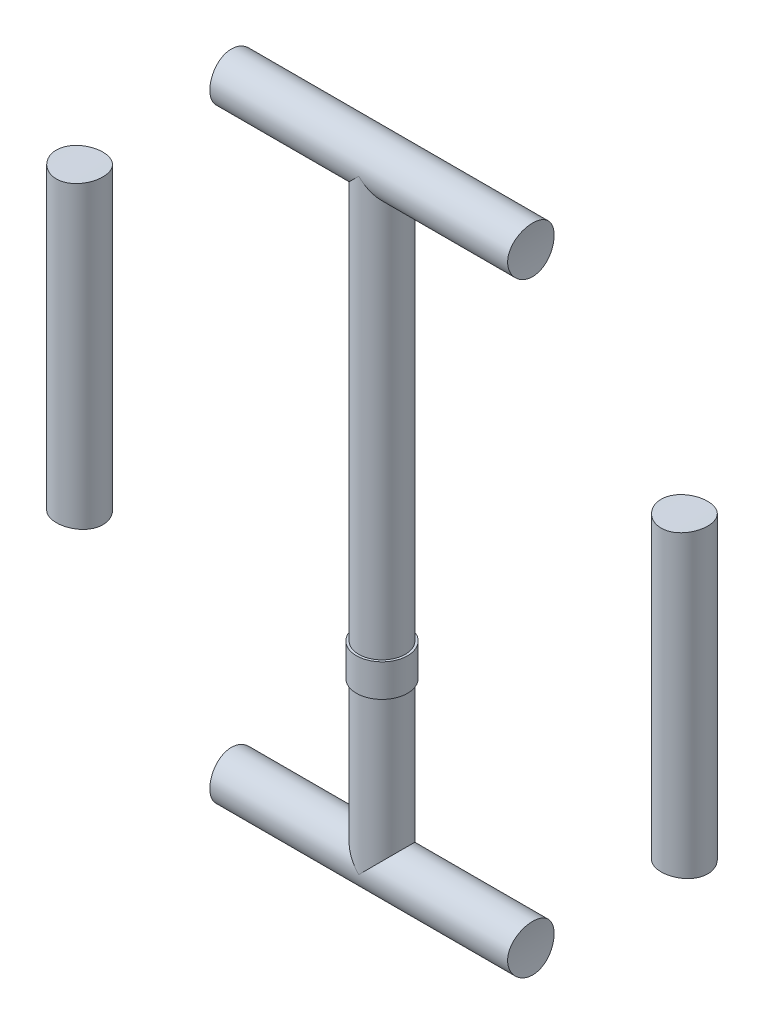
ISO-10303-21;
HEADER;
FILE_DESCRIPTION(('STEP AP214'),'2;1');
FILE_NAME('part.step','',(''),(''),'','','');
FILE_SCHEMA(('AUTOMOTIVE_DESIGN { 1 0 10303 214 1 1 1 1 }'));
ENDSEC;
DATA;
#1=APPLICATION_CONTEXT('core data for automotive mechanical design processes');
#2=APPLICATION_PROTOCOL_DEFINITION('international standard','automotive_design',2000,#1);
#3=PRODUCT_CONTEXT('',#1,'mechanical');
#4=PRODUCT('Part','Part','',(#3));
#5=PRODUCT_RELATED_PRODUCT_CATEGORY('part','',(#4));
#6=PRODUCT_DEFINITION_FORMATION('','',#4);
#7=PRODUCT_DEFINITION_CONTEXT('part definition',#1,'design');
#8=PRODUCT_DEFINITION('design','',#6,#7);
#9=PRODUCT_DEFINITION_SHAPE('','',#8);
#10=(LENGTH_UNIT() NAMED_UNIT(*) SI_UNIT(.MILLI.,.METRE.));
#11=(NAMED_UNIT(*) PLANE_ANGLE_UNIT() SI_UNIT($,.RADIAN.));
#12=(NAMED_UNIT(*) SI_UNIT($,.STERADIAN.) SOLID_ANGLE_UNIT());
#13=UNCERTAINTY_MEASURE_WITH_UNIT(LENGTH_MEASURE(1.E-05),#10,'distance_accuracy_value','');
#14=(GEOMETRIC_REPRESENTATION_CONTEXT(3) GLOBAL_UNCERTAINTY_ASSIGNED_CONTEXT((#13)) GLOBAL_UNIT_ASSIGNED_CONTEXT((#10,
#11,#12)) REPRESENTATION_CONTEXT('',''));
#15=CARTESIAN_POINT('',(0.,0.,0.));
#16=DIRECTION('',(0.,0.,1.));
#17=DIRECTION('',(1.,0.,0.));
#18=AXIS2_PLACEMENT_3D('',#15,#16,#17);
#19=CARTESIAN_POINT('',(932.842712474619,650.,0.));
#20=DIRECTION('',(-1.,0.,0.));
#21=DIRECTION('',(0.,0.,1.));
#22=AXIS2_PLACEMENT_3D('',#19,#20,#21);
#23=CYLINDRICAL_SURFACE('',#22,50.);
#24=CARTESIAN_POINT('',(-320.,650.,50.));
#25=CARTESIAN_POINT('',(-320.000003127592,648.604105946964,49.9999914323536));
#26=CARTESIAN_POINT('',(-320.008880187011,647.207997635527,49.9414943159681));
#27=CARTESIAN_POINT('',(-320.044149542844,644.425615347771,49.7079089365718));
#28=CARTESIAN_POINT('',(-320.070545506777,643.039343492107,49.5327962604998));
#29=CARTESIAN_POINT('',(-320.140140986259,640.285471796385,49.0670932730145));
#30=CARTESIAN_POINT('',(-320.183355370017,638.917889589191,48.7764007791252));
#31=CARTESIAN_POINT('',(-320.285370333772,636.212485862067,48.0817520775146));
#32=CARTESIAN_POINT('',(-320.344170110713,634.874662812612,47.6778017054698));
#33=CARTESIAN_POINT('',(-320.475660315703,632.239108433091,46.7599871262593));
#34=CARTESIAN_POINT('',(-320.548340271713,630.941347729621,46.2462057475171));
#35=CARTESIAN_POINT('',(-320.705595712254,628.393886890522,45.1123015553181));
#36=CARTESIAN_POINT('',(-320.790171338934,627.144187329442,44.4921774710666));
#37=CARTESIAN_POINT('',(-320.968856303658,624.701661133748,43.1501507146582));
#38=CARTESIAN_POINT('',(-321.062964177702,623.508825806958,42.4282636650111));
#39=CARTESIAN_POINT('',(-321.258120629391,621.187968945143,40.8877341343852));
#40=CARTESIAN_POINT('',(-321.359169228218,620.059947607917,40.0690913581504));
#41=CARTESIAN_POINT('',(-321.566151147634,617.868597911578,38.3345733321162));
#42=CARTESIAN_POINT('',(-321.672114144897,616.805787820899,37.4180467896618));
#43=CARTESIAN_POINT('',(-321.885279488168,614.760999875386,35.498998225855));
#44=CARTESIAN_POINT('',(-321.992481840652,613.779022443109,34.4964757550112));
#45=CARTESIAN_POINT('',(-322.205120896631,611.902636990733,32.4122998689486));
#46=CARTESIAN_POINT('',(-322.310557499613,611.008233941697,31.3306419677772));
#47=CARTESIAN_POINT('',(-322.516685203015,609.313299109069,29.0956925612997));
#48=CARTESIAN_POINT('',(-322.61737629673,608.51276745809,27.9424009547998));
#49=CARTESIAN_POINT('',(-322.811646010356,607.007440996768,25.5661485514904));
#50=CARTESIAN_POINT('',(-322.905186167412,606.303149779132,24.3428655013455));
#51=CARTESIAN_POINT('',(-323.08188810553,605.000215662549,21.840540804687));
#52=CARTESIAN_POINT('',(-323.165049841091,604.401573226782,20.5614989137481));
#53=CARTESIAN_POINT('',(-323.318572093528,603.314389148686,17.9567616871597));
#54=CARTESIAN_POINT('',(-323.388933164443,602.825842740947,16.631068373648));
#55=CARTESIAN_POINT('',(-323.51479480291,601.962501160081,13.9424584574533));
#56=CARTESIAN_POINT('',(-323.570295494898,601.587705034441,12.579542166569));
#57=CARTESIAN_POINT('',(-323.664437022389,600.957148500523,9.83684789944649));
#58=CARTESIAN_POINT('',(-323.703203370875,600.700500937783,8.45727816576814));
#59=CARTESIAN_POINT('',(-323.763354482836,600.304009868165,5.68107814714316));
#60=CARTESIAN_POINT('',(-323.784739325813,600.164165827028,4.28444794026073));
#61=CARTESIAN_POINT('',(-323.809498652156,600.002364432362,1.48428845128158));
#62=CARTESIAN_POINT('',(-323.812874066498,599.980400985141,0.0807595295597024));
#63=CARTESIAN_POINT('',(-323.801517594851,600.054514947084,-2.72310078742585));
#64=CARTESIAN_POINT('',(-323.786785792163,600.150591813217,-4.12343219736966));
#65=CARTESIAN_POINT('',(-323.739848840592,600.458727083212,-6.89893825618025));
#66=CARTESIAN_POINT('',(-323.707792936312,600.669794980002,-8.27422553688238));
#67=CARTESIAN_POINT('',(-323.627230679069,601.205648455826,-11.0019618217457));
#68=CARTESIAN_POINT('',(-323.578724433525,601.530433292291,-12.3544109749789));
#69=CARTESIAN_POINT('',(-323.466650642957,602.291306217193,-15.0270098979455));
#70=CARTESIAN_POINT('',(-323.403082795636,602.727396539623,-16.3471590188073));
#71=CARTESIAN_POINT('',(-323.26269608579,603.70767672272,-18.9459633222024));
#72=CARTESIAN_POINT('',(-323.185877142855,604.251867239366,-20.2246182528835));
#73=CARTESIAN_POINT('',(-323.020829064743,605.446809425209,-22.7366554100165));
#74=CARTESIAN_POINT('',(-322.93255551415,606.097978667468,-23.9698360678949));
#75=CARTESIAN_POINT('',(-322.747333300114,607.500678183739,-26.3770397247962));
#76=CARTESIAN_POINT('',(-322.650384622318,608.25220862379,-27.5510626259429));
#77=CARTESIAN_POINT('',(-322.450525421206,609.850404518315,-29.8320187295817));
#78=CARTESIAN_POINT('',(-322.347614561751,610.697075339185,-30.9389481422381));
#79=CARTESIAN_POINT('',(-322.138703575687,612.479667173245,-33.0781363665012));
#80=CARTESIAN_POINT('',(-322.032703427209,613.415588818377,-34.1103946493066));
#81=CARTESIAN_POINT('',(-321.81946896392,615.380279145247,-36.103363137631));
#82=CARTESIAN_POINT('',(-321.712233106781,616.409898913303,-37.0632343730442));
#83=CARTESIAN_POINT('',(-321.500634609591,618.546555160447,-38.8929183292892));
#84=CARTESIAN_POINT('',(-321.396271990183,619.653592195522,-39.7627304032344));
#85=CARTESIAN_POINT('',(-321.193361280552,621.937421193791,-41.4061693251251));
#86=CARTESIAN_POINT('',(-321.09481323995,623.114213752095,-42.1797953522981));
#87=CARTESIAN_POINT('',(-320.906313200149,625.529361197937,-43.6253187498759));
#88=CARTESIAN_POINT('',(-320.816361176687,626.767715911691,-44.2972164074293));
#89=CARTESIAN_POINT('',(-320.647543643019,629.298113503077,-45.5347859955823));
#90=CARTESIAN_POINT('',(-320.568685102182,630.590189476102,-46.1003912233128));
#91=CARTESIAN_POINT('',(-320.424361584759,633.218161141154,-47.1206606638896));
#92=CARTESIAN_POINT('',(-320.358896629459,634.554056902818,-47.5753247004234));
#93=CARTESIAN_POINT('',(-320.243230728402,637.260032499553,-48.3702559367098));
#94=CARTESIAN_POINT('',(-320.193028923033,638.630110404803,-48.7105295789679));
#95=CARTESIAN_POINT('',(-320.109321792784,641.394616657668,-49.2741042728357));
#96=CARTESIAN_POINT('',(-320.075816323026,642.789044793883,-49.4974063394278));
#97=CARTESIAN_POINT('',(-320.026703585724,645.578416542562,-49.8237104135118));
#98=CARTESIAN_POINT('',(-320.010924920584,646.973222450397,-49.9278646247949));
#99=CARTESIAN_POINT('',(-319.997126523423,649.766740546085,-50.0189820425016));
#100=CARTESIAN_POINT('',(-319.999106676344,651.165452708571,-50.0059460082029));
#101=CARTESIAN_POINT('',(-320.020769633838,653.956688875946,-49.8627861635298));
#102=CARTESIAN_POINT('',(-320.040451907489,655.349213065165,-49.7326658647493));
#103=CARTESIAN_POINT('',(-320.09696340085,658.118129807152,-49.3563379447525));
#104=CARTESIAN_POINT('',(-320.133792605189,659.49452237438,-49.1101304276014));
#105=CARTESIAN_POINT('',(-320.22333917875,662.214610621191,-48.5049995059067));
#106=CARTESIAN_POINT('',(-320.275977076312,663.558434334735,-48.1466395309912));
#107=CARTESIAN_POINT('',(-320.395741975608,666.210978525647,-47.3194908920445));
#108=CARTESIAN_POINT('',(-320.462868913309,667.519699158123,-46.8507027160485));
#109=CARTESIAN_POINT('',(-320.60975768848,670.093019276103,-45.8061017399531));
#110=CARTESIAN_POINT('',(-320.689519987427,671.357617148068,-45.2302850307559));
#111=CARTESIAN_POINT('',(-320.859479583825,673.833975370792,-43.9757683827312));
#112=CARTESIAN_POINT('',(-320.949676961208,675.045735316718,-43.2970676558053));
#113=CARTESIAN_POINT('',(-321.138726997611,677.416935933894,-41.8361704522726));
#114=CARTESIAN_POINT('',(-321.237638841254,678.575922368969,-41.0532443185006));
#115=CARTESIAN_POINT('',(-321.440785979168,680.823966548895,-39.3933416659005));
#116=CARTESIAN_POINT('',(-321.545021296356,681.91302399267,-38.5163647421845));
#117=CARTESIAN_POINT('',(-321.755922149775,684.01382274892,-36.6743985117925));
#118=CARTESIAN_POINT('',(-321.862587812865,685.025560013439,-35.7094046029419));
#119=CARTESIAN_POINT('',(-322.075373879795,686.964730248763,-33.6980741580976));
#120=CARTESIAN_POINT('',(-322.181494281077,687.892162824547,-32.6517372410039));
#121=CARTESIAN_POINT('',(-322.391112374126,689.66383059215,-30.4756579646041));
#122=CARTESIAN_POINT('',(-322.494580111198,690.507291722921,-29.3452823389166));
#123=CARTESIAN_POINT('',(-322.694990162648,692.095983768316,-27.0169290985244));
#124=CARTESIAN_POINT('',(-322.791932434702,692.841214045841,-25.8189510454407));
#125=CARTESIAN_POINT('',(-322.976501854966,694.228059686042,-23.3637854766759));
#126=CARTESIAN_POINT('',(-323.064129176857,694.869676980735,-22.1065990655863));
#127=CARTESIAN_POINT('',(-323.227531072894,696.0446043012,-19.5418517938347));
#128=CARTESIAN_POINT('',(-323.303305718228,696.577914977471,-18.2342912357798));
#129=CARTESIAN_POINT('',(-323.440541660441,697.530528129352,-15.5828783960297));
#130=CARTESIAN_POINT('',(-323.502053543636,697.950234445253,-14.2391738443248));
#131=CARTESIAN_POINT('',(-323.609315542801,698.674998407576,-11.5205694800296));
#132=CARTESIAN_POINT('',(-323.655065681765,698.980056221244,-10.1456697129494));
#133=CARTESIAN_POINT('',(-323.729456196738,699.473169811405,-7.37466943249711));
#134=CARTESIAN_POINT('',(-323.758097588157,699.661232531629,-5.97857018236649));
#135=CARTESIAN_POINT('',(-323.797428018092,699.918925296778,-3.1752359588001));
#136=CARTESIAN_POINT('',(-323.808117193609,699.988556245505,-1.76800107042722));
#137=CARTESIAN_POINT('',(-323.811211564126,700.008742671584,1.03287011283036));
#138=CARTESIAN_POINT('',(-323.803803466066,699.96051408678,2.42649759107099));
#139=CARTESIAN_POINT('',(-323.771308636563,699.747889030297,5.20464569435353));
#140=CARTESIAN_POINT('',(-323.746222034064,699.583493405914,6.58916638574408));
#141=CARTESIAN_POINT('',(-323.679097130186,699.139786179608,9.33923805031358));
#142=CARTESIAN_POINT('',(-323.637058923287,698.860475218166,10.7047891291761));
#143=CARTESIAN_POINT('',(-323.537243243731,698.189039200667,13.4072773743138));
#144=CARTESIAN_POINT('',(-323.479465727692,697.796913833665,14.7442144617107));
#145=CARTESIAN_POINT('',(-323.349879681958,696.903117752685,17.3790484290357));
#146=CARTESIAN_POINT('',(-323.278082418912,696.401534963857,18.6769756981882));
#147=CARTESIAN_POINT('',(-323.122467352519,695.292296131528,21.2259231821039));
#148=CARTESIAN_POINT('',(-323.038649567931,694.684640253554,22.4769434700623));
#149=CARTESIAN_POINT('',(-322.861353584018,693.367583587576,24.9235404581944));
#150=CARTESIAN_POINT('',(-322.767875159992,692.658180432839,26.119115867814));
#151=CARTESIAN_POINT('',(-322.573873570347,691.142619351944,28.4466788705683));
#152=CARTESIAN_POINT('',(-322.473350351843,690.336460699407,29.578665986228));
#153=CARTESIAN_POINT('',(-322.267042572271,688.624589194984,31.7821748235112));
#154=CARTESIAN_POINT('',(-322.161216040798,687.717976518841,32.852993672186));
#155=CARTESIAN_POINT('',(-321.948206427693,685.818071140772,34.9146217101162));
#156=CARTESIAN_POINT('',(-321.841023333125,684.824777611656,35.9054301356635));
#157=CARTESIAN_POINT('',(-321.628283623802,682.758127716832,37.8004102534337));
#158=CARTESIAN_POINT('',(-321.52272739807,681.684752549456,38.7045614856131));
#159=CARTESIAN_POINT('',(-321.316226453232,679.465549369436,40.4196483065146));
#160=CARTESIAN_POINT('',(-321.215281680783,678.319722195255,41.2305849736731));
#161=CARTESIAN_POINT('',(-321.020284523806,675.956881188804,42.7578093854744));
#162=CARTESIAN_POINT('',(-320.926274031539,674.739503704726,43.473539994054));
#163=CARTESIAN_POINT('',(-320.748439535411,672.247912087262,44.7998011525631));
#164=CARTESIAN_POINT('',(-320.664616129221,670.973694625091,45.4103255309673));
#165=CARTESIAN_POINT('',(-320.509622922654,668.378773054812,46.5210798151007));
#166=CARTESIAN_POINT('',(-320.438441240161,667.058114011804,47.0214133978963));
#167=CARTESIAN_POINT('',(-320.310677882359,664.378744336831,47.9086868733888));
#168=CARTESIAN_POINT('',(-320.254092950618,663.020042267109,48.2956520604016));
#169=CARTESIAN_POINT('',(-320.171976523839,660.695057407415,48.8525871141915));
#170=CARTESIAN_POINT('',(-320.142241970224,659.736028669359,49.0527186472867));
#171=CARTESIAN_POINT('',(-320.090961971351,657.807483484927,49.3963807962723));
#172=CARTESIAN_POINT('',(-320.069417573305,656.83796571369,49.5399041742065));
#173=CARTESIAN_POINT('',(-320.034827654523,654.892031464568,49.7697487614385));
#174=CARTESIAN_POINT('',(-320.021782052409,653.915615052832,49.8560705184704));
#175=CARTESIAN_POINT('',(-320.004367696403,651.959500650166,49.9711953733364));
#176=CARTESIAN_POINT('',(-319.999997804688,650.979803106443,50.0000060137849));
#177=CARTESIAN_POINT('',(-320.,650.,50.));
#178=B_SPLINE_CURVE_WITH_KNOTS('',3,(#24,#25,#26,#27,#28,#29,#30,#31,#32,#33,#34,#35,#36,#37,
#38,#39,#40,#41,#42,#43,#44,#45,#46,#47,#48,#49,#50,#51,#52,#53,#54,#55,#56,#57,#58,#59,#60,#61,
#62,#63,#64,#65,#66,#67,#68,#69,#70,#71,#72,#73,#74,#75,#76,#77,#78,#79,#80,#81,#82,#83,#84,#85,
#86,#87,#88,#89,#90,#91,#92,#93,#94,#95,#96,#97,#98,#99,#100,#101,#102,#103,#104,#105,#106,#107,
#108,#109,#110,#111,#112,#113,#114,#115,#116,#117,#118,#119,#120,#121,#122,#123,#124,#125,#126,
#127,#128,#129,#130,#131,#132,#133,#134,#135,#136,#137,#138,#139,#140,#141,#142,#143,#144,#145,
#146,#147,#148,#149,#150,#151,#152,#153,#154,#155,#156,#157,#158,#159,#160,#161,#162,#163,#164,
#165,#166,#167,#168,#169,#170,#171,#172,#173,#174,#175,#176,#177),.UNSPECIFIED.,.T.,.F.,(4,2,2,
2,2,2,2,2,2,2,2,2,2,2,2,2,2,2,2,2,2,2,2,2,2,2,2,2,2,2,2,2,2,2,2,2,2,2,2,2,2,2,2,2,2,2,2,2,2,2,2,
2,2,2,2,2,2,2,2,2,2,2,2,2,2,2,2,2,2,2,2,2,2,2,2,2,4),(0.,4.18680278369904,8.37448233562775,
12.5658724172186,16.7570465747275,20.945071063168,25.133145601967,29.320577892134,
33.5080229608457,37.7253070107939,41.9426131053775,46.160158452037,50.377709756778,
54.6165477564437,58.8554043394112,63.0940774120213,67.3327149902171,71.538984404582,
75.7452345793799,79.9512673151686,84.1572807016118,88.3276244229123,92.4979409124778,
96.6683411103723,100.838766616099,105.025875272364,109.212990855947,113.400342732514,
117.5877242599,121.817897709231,126.048101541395,130.278341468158,134.50856945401,
138.741443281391,142.9743238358,147.206965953,151.439571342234,155.630890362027,159.82218222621,
164.013348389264,168.204510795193,172.374946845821,176.545364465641,180.715934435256,
184.886536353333,189.088043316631,193.289568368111,197.49131323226,201.693077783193,
205.930552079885,210.168053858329,214.405476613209,218.642873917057,222.86500418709,
227.087128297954,231.309001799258,235.530843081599,239.70931252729,243.887751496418,
248.066167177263,252.244594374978,256.419677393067,260.594753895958,264.769927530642,
268.945132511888,273.161335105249,277.377577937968,281.594813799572,285.81200086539,
290.052872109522,294.293992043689,298.53110435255,302.767270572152,305.70610064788,
308.645306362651,311.584483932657,314.523276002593),.UNSPECIFIED.);
#179=CARTESIAN_POINT('',(-320.,650.,50.));
#180=VERTEX_POINT('',#179);
#181=EDGE_CURVE('E94',#180,#180,#178,.T.);
#182=ORIENTED_EDGE('',*,*,#181,.T.);
#183=EDGE_LOOP('',(#182));
#184=FACE_BOUND('',#183,.T.);
#185=CARTESIAN_POINT('',(320.,650.,50.));
#186=CARTESIAN_POINT('',(320.000003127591,651.395894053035,49.9999914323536));
#187=CARTESIAN_POINT('',(320.00888018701,652.792002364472,49.9414943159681));
#188=CARTESIAN_POINT('',(320.044149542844,655.574384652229,49.7079089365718));
#189=CARTESIAN_POINT('',(320.070545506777,656.960656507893,49.5327962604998));
#190=CARTESIAN_POINT('',(320.140140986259,659.714528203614,49.0670932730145));
#191=CARTESIAN_POINT('',(320.183355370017,661.082110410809,48.7764007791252));
#192=CARTESIAN_POINT('',(320.285370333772,663.787514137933,48.0817520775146));
#193=CARTESIAN_POINT('',(320.344170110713,665.125337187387,47.6778017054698));
#194=CARTESIAN_POINT('',(320.475660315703,667.760891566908,46.7599871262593));
#195=CARTESIAN_POINT('',(320.548340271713,669.058652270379,46.2462057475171));
#196=CARTESIAN_POINT('',(320.705595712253,671.606113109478,45.1123015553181));
#197=CARTESIAN_POINT('',(320.790171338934,672.855812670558,44.4921774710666));
#198=CARTESIAN_POINT('',(320.968856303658,675.298338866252,43.1501507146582));
#199=CARTESIAN_POINT('',(321.062964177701,676.491174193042,42.4282636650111));
#200=CARTESIAN_POINT('',(321.258120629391,678.812031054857,40.8877341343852));
#201=CARTESIAN_POINT('',(321.359169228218,679.940052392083,40.0690913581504));
#202=CARTESIAN_POINT('',(321.566151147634,682.131402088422,38.3345733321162));
#203=CARTESIAN_POINT('',(321.672114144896,683.194212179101,37.4180467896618));
#204=CARTESIAN_POINT('',(321.885279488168,685.239000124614,35.498998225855));
#205=CARTESIAN_POINT('',(321.992481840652,686.220977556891,34.4964757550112));
#206=CARTESIAN_POINT('',(322.205120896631,688.097363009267,32.4122998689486));
#207=CARTESIAN_POINT('',(322.310557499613,688.991766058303,31.3306419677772));
#208=CARTESIAN_POINT('',(322.516685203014,690.686700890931,29.0956925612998));
#209=CARTESIAN_POINT('',(322.61737629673,691.48723254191,27.9424009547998));
#210=CARTESIAN_POINT('',(322.811646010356,692.992559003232,25.5661485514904));
#211=CARTESIAN_POINT('',(322.905186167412,693.696850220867,24.3428655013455));
#212=CARTESIAN_POINT('',(323.08188810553,694.999784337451,21.8405408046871));
#213=CARTESIAN_POINT('',(323.165049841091,695.598426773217,20.5614989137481));
#214=CARTESIAN_POINT('',(323.318572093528,696.685610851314,17.9567616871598));
#215=CARTESIAN_POINT('',(323.388933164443,697.174157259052,16.631068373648));
#216=CARTESIAN_POINT('',(323.51479480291,698.037498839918,13.9424584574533));
#217=CARTESIAN_POINT('',(323.570295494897,698.412294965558,12.579542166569));
#218=CARTESIAN_POINT('',(323.664437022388,699.042851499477,9.83684789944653));
#219=CARTESIAN_POINT('',(323.703203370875,699.299499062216,8.45727816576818));
#220=CARTESIAN_POINT('',(323.763354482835,699.695990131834,5.6810781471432));
#221=CARTESIAN_POINT('',(323.784739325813,699.835834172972,4.28444794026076));
#222=CARTESIAN_POINT('',(323.809498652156,699.997635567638,1.48428845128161));
#223=CARTESIAN_POINT('',(323.812874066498,700.019599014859,0.0807595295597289));
#224=CARTESIAN_POINT('',(323.801517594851,699.945485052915,-2.72310078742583));
#225=CARTESIAN_POINT('',(323.786785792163,699.849408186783,-4.12343219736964));
#226=CARTESIAN_POINT('',(323.739848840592,699.541272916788,-6.89893825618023));
#227=CARTESIAN_POINT('',(323.707792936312,699.330205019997,-8.27422553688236));
#228=CARTESIAN_POINT('',(323.627230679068,698.794351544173,-11.0019618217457));
#229=CARTESIAN_POINT('',(323.578724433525,698.469566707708,-12.3544109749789));
#230=CARTESIAN_POINT('',(323.466650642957,697.708693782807,-15.0270098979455));
#231=CARTESIAN_POINT('',(323.403082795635,697.272603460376,-16.3471590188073));
#232=CARTESIAN_POINT('',(323.26269608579,696.292323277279,-18.9459633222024));
#233=CARTESIAN_POINT('',(323.185877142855,695.748132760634,-20.2246182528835));
#234=CARTESIAN_POINT('',(323.020829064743,694.553190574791,-22.7366554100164));
#235=CARTESIAN_POINT('',(322.93255551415,693.902021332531,-23.9698360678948));
#236=CARTESIAN_POINT('',(322.747333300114,692.499321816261,-26.3770397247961));
#237=CARTESIAN_POINT('',(322.650384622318,691.74779137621,-27.5510626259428));
#238=CARTESIAN_POINT('',(322.450525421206,690.149595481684,-29.8320187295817));
#239=CARTESIAN_POINT('',(322.347614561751,689.302924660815,-30.938948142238));
#240=CARTESIAN_POINT('',(322.138703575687,687.520332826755,-33.0781363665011));
#241=CARTESIAN_POINT('',(322.032703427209,686.584411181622,-34.1103946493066));
#242=CARTESIAN_POINT('',(321.81946896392,684.619720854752,-36.103363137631));
#243=CARTESIAN_POINT('',(321.712233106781,683.590101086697,-37.0632343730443));
#244=CARTESIAN_POINT('',(321.500634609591,681.453444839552,-38.8929183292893));
#245=CARTESIAN_POINT('',(321.396271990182,680.346407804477,-39.7627304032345));
#246=CARTESIAN_POINT('',(321.193361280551,678.062578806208,-41.4061693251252));
#247=CARTESIAN_POINT('',(321.09481323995,676.885786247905,-42.1797953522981));
#248=CARTESIAN_POINT('',(320.906313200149,674.470638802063,-43.625318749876));
#249=CARTESIAN_POINT('',(320.816361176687,673.232284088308,-44.2972164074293));
#250=CARTESIAN_POINT('',(320.647543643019,670.701886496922,-45.5347859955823));
#251=CARTESIAN_POINT('',(320.568685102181,669.409810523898,-46.1003912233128));
#252=CARTESIAN_POINT('',(320.424361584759,666.781838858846,-47.1206606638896));
#253=CARTESIAN_POINT('',(320.358896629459,665.445943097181,-47.5753247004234));
#254=CARTESIAN_POINT('',(320.243230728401,662.739967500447,-48.3702559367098));
#255=CARTESIAN_POINT('',(320.193028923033,661.369889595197,-48.7105295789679));
#256=CARTESIAN_POINT('',(320.109321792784,658.605383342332,-49.2741042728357));
#257=CARTESIAN_POINT('',(320.075816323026,657.210955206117,-49.4974063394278));
#258=CARTESIAN_POINT('',(320.026703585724,654.421583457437,-49.8237104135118));
#259=CARTESIAN_POINT('',(320.010924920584,653.026777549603,-49.9278646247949));
#260=CARTESIAN_POINT('',(319.997126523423,650.233259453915,-50.0189820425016));
#261=CARTESIAN_POINT('',(319.999106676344,648.834547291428,-50.0059460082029));
#262=CARTESIAN_POINT('',(320.020769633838,646.043311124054,-49.8627861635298));
#263=CARTESIAN_POINT('',(320.040451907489,644.650786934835,-49.7326658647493));
#264=CARTESIAN_POINT('',(320.09696340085,641.881870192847,-49.3563379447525));
#265=CARTESIAN_POINT('',(320.133792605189,640.505477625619,-49.1101304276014));
#266=CARTESIAN_POINT('',(320.22333917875,637.785389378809,-48.5049995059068));
#267=CARTESIAN_POINT('',(320.275977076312,636.441565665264,-48.1466395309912));
#268=CARTESIAN_POINT('',(320.395741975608,633.789021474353,-47.3194908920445));
#269=CARTESIAN_POINT('',(320.462868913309,632.480300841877,-46.8507027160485));
#270=CARTESIAN_POINT('',(320.60975768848,629.906980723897,-45.8061017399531));
#271=CARTESIAN_POINT('',(320.689519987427,628.642382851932,-45.2302850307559));
#272=CARTESIAN_POINT('',(320.859479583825,626.166024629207,-43.9757683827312));
#273=CARTESIAN_POINT('',(320.949676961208,624.954264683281,-43.2970676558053));
#274=CARTESIAN_POINT('',(321.138726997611,622.583064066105,-41.8361704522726));
#275=CARTESIAN_POINT('',(321.237638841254,621.42407763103,-41.0532443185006));
#276=CARTESIAN_POINT('',(321.440785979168,619.176033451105,-39.3933416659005));
#277=CARTESIAN_POINT('',(321.545021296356,618.08697600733,-38.5163647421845));
#278=CARTESIAN_POINT('',(321.755922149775,615.98617725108,-36.6743985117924));
#279=CARTESIAN_POINT('',(321.862587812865,614.974439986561,-35.7094046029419));
#280=CARTESIAN_POINT('',(322.075373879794,613.035269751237,-33.6980741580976));
#281=CARTESIAN_POINT('',(322.181494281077,612.107837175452,-32.6517372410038));
#282=CARTESIAN_POINT('',(322.391112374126,610.336169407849,-30.4756579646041));
#283=CARTESIAN_POINT('',(322.494580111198,609.492708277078,-29.3452823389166));
#284=CARTESIAN_POINT('',(322.694990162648,607.904016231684,-27.0169290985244));
#285=CARTESIAN_POINT('',(322.791932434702,607.158785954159,-25.8189510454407));
#286=CARTESIAN_POINT('',(322.976501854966,605.771940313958,-23.3637854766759));
#287=CARTESIAN_POINT('',(323.064129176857,605.130323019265,-22.1065990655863));
#288=CARTESIAN_POINT('',(323.227531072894,603.955395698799,-19.5418517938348));
#289=CARTESIAN_POINT('',(323.303305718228,603.422085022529,-18.2342912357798));
#290=CARTESIAN_POINT('',(323.440541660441,602.469471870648,-15.5828783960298));
#291=CARTESIAN_POINT('',(323.502053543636,602.049765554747,-14.2391738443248));
#292=CARTESIAN_POINT('',(323.609315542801,601.325001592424,-11.5205694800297));
#293=CARTESIAN_POINT('',(323.655065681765,601.019943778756,-10.1456697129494));
#294=CARTESIAN_POINT('',(323.729456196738,600.526830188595,-7.37466943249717));
#295=CARTESIAN_POINT('',(323.758097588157,600.338767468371,-5.97857018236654));
#296=CARTESIAN_POINT('',(323.797428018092,600.081074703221,-3.17523595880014));
#297=CARTESIAN_POINT('',(323.808117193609,600.011443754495,-1.76800107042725));
#298=CARTESIAN_POINT('',(323.811211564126,599.991257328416,1.03287011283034));
#299=CARTESIAN_POINT('',(323.803803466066,600.039485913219,2.42649759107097));
#300=CARTESIAN_POINT('',(323.771308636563,600.252110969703,5.20464569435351));
#301=CARTESIAN_POINT('',(323.746222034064,600.416506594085,6.58916638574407));
#302=CARTESIAN_POINT('',(323.679097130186,600.860213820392,9.33923805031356));
#303=CARTESIAN_POINT('',(323.637058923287,601.139524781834,10.7047891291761));
#304=CARTESIAN_POINT('',(323.537243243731,601.810960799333,13.4072773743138));
#305=CARTESIAN_POINT('',(323.479465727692,602.203086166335,14.7442144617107));
#306=CARTESIAN_POINT('',(323.349879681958,603.096882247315,17.3790484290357));
#307=CARTESIAN_POINT('',(323.278082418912,603.598465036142,18.6769756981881));
#308=CARTESIAN_POINT('',(323.122467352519,604.707703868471,21.2259231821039));
#309=CARTESIAN_POINT('',(323.038649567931,605.315359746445,22.4769434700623));
#310=CARTESIAN_POINT('',(322.861353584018,606.632416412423,24.9235404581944));
#311=CARTESIAN_POINT('',(322.767875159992,607.341819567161,26.1191158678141));
#312=CARTESIAN_POINT('',(322.573873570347,608.857380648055,28.4466788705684));
#313=CARTESIAN_POINT('',(322.473350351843,609.663539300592,29.5786659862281));
#314=CARTESIAN_POINT('',(322.267042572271,611.375410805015,31.7821748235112));
#315=CARTESIAN_POINT('',(322.161216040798,612.282023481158,32.852993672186));
#316=CARTESIAN_POINT('',(321.948206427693,614.181928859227,34.9146217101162));
#317=CARTESIAN_POINT('',(321.841023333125,615.175222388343,35.9054301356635));
#318=CARTESIAN_POINT('',(321.628283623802,617.241872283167,37.8004102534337));
#319=CARTESIAN_POINT('',(321.52272739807,618.315247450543,38.7045614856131));
#320=CARTESIAN_POINT('',(321.316226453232,620.534450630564,40.4196483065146));
#321=CARTESIAN_POINT('',(321.215281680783,621.680277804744,41.2305849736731));
#322=CARTESIAN_POINT('',(321.020284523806,624.043118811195,42.7578093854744));
#323=CARTESIAN_POINT('',(320.926274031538,625.260496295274,43.473539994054));
#324=CARTESIAN_POINT('',(320.748439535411,627.752087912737,44.7998011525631));
#325=CARTESIAN_POINT('',(320.664616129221,629.026305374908,45.4103255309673));
#326=CARTESIAN_POINT('',(320.509622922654,631.621226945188,46.5210798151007));
#327=CARTESIAN_POINT('',(320.438441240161,632.941885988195,47.0214133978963));
#328=CARTESIAN_POINT('',(320.310677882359,635.621255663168,47.9086868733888));
#329=CARTESIAN_POINT('',(320.254092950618,636.979957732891,48.2956520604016));
#330=CARTESIAN_POINT('',(320.171976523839,639.304942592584,48.8525871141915));
#331=CARTESIAN_POINT('',(320.142241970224,640.263971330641,49.0527186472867));
#332=CARTESIAN_POINT('',(320.090961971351,642.192516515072,49.3963807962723));
#333=CARTESIAN_POINT('',(320.069417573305,643.162034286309,49.5399041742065));
#334=CARTESIAN_POINT('',(320.034827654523,645.107968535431,49.7697487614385));
#335=CARTESIAN_POINT('',(320.021782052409,646.084384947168,49.8560705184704));
#336=CARTESIAN_POINT('',(320.004367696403,648.040499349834,49.9711953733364));
#337=CARTESIAN_POINT('',(319.999997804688,649.020196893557,50.0000060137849));
#338=CARTESIAN_POINT('',(320.,650.,50.));
#339=B_SPLINE_CURVE_WITH_KNOTS('',3,(#185,#186,#187,#188,#189,#190,#191,#192,#193,#194,#195,
#196,#197,#198,#199,#200,#201,#202,#203,#204,#205,#206,#207,#208,#209,#210,#211,#212,#213,#214,
#215,#216,#217,#218,#219,#220,#221,#222,#223,#224,#225,#226,#227,#228,#229,#230,#231,#232,#233,
#234,#235,#236,#237,#238,#239,#240,#241,#242,#243,#244,#245,#246,#247,#248,#249,#250,#251,#252,
#253,#254,#255,#256,#257,#258,#259,#260,#261,#262,#263,#264,#265,#266,#267,#268,#269,#270,#271,
#272,#273,#274,#275,#276,#277,#278,#279,#280,#281,#282,#283,#284,#285,#286,#287,#288,#289,#290,
#291,#292,#293,#294,#295,#296,#297,#298,#299,#300,#301,#302,#303,#304,#305,#306,#307,#308,#309,
#310,#311,#312,#313,#314,#315,#316,#317,#318,#319,#320,#321,#322,#323,#324,#325,#326,#327,#328,
#329,#330,#331,#332,#333,#334,#335,#336,#337,#338),.UNSPECIFIED.,.T.,.F.,(4,2,2,2,2,2,2,2,2,2,2,
2,2,2,2,2,2,2,2,2,2,2,2,2,2,2,2,2,2,2,2,2,2,2,2,2,2,2,2,2,2,2,2,2,2,2,2,2,2,2,2,2,2,2,2,2,2,2,2,
2,2,2,2,2,2,2,2,2,2,2,2,2,2,2,2,2,4),(0.,4.18680278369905,8.37448233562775,12.5658724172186,
16.7570465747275,20.945071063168,25.133145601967,29.320577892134,33.5080229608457,
37.7253070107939,41.9426131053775,46.1601584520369,50.377709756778,54.6165477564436,
58.8554043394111,63.0940774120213,67.3327149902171,71.5389844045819,75.7452345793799,
79.9512673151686,84.1572807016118,88.3276244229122,92.4979409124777,96.6683411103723,
100.838766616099,105.025875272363,109.212990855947,113.400342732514,117.5877242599,
121.817897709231,126.048101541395,130.278341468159,134.50856945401,138.741443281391,
142.9743238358,147.206965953,151.439571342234,155.630890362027,159.82218222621,164.013348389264,
168.204510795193,172.374946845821,176.545364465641,180.715934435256,184.886536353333,
189.088043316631,193.289568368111,197.49131323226,201.693077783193,205.930552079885,
210.168053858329,214.405476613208,218.642873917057,222.86500418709,227.087128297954,
231.309001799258,235.530843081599,239.70931252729,243.887751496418,248.066167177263,
252.244594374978,256.419677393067,260.594753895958,264.769927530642,268.945132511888,
273.161335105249,277.377577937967,281.594813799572,285.81200086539,290.052872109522,
294.293992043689,298.53110435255,302.767270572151,305.70610064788,308.645306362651,
311.584483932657,314.523276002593),.UNSPECIFIED.);
#340=CARTESIAN_POINT('',(320.,650.,50.));
#341=VERTEX_POINT('',#340);
#342=EDGE_CURVE('E87',#341,#341,#339,.T.);
#343=ORIENTED_EDGE('',*,*,#342,.T.);
#344=EDGE_LOOP('',(#343));
#345=FACE_BOUND('',#344,.T.);
#346=CARTESIAN_POINT('',(0.,650.,0.));
#347=DIRECTION('',(-0.707106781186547,-0.707106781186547,0.));
#348=DIRECTION('',(0.707106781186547,-0.707106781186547,0.));
#349=AXIS2_PLACEMENT_3D('',#346,#347,#348);
#350=ELLIPSE('',#349,70.7106781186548,50.);
#351=CARTESIAN_POINT('',(0.,650.,50.));
#352=VERTEX_POINT('',#351);
#353=CARTESIAN_POINT('',(0.,650.,-50.));
#354=VERTEX_POINT('',#353);
#355=EDGE_CURVE('E82',#352,#354,#350,.F.);
#356=ORIENTED_EDGE('',*,*,#355,.T.);
#357=CARTESIAN_POINT('',(0.,650.,0.));
#358=DIRECTION('',(0.707106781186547,-0.707106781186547,0.));
#359=DIRECTION('',(-0.707106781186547,-0.707106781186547,0.));
#360=AXIS2_PLACEMENT_3D('',#357,#358,#359);
#361=ELLIPSE('',#360,70.7106781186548,50.);
#362=EDGE_CURVE('E65',#354,#352,#361,.F.);
#363=ORIENTED_EDGE('',*,*,#362,.T.);
#364=EDGE_LOOP('',(#356,#363));
#365=FACE_BOUND('',#364,.T.);
#366=ADVANCED_FACE('F48',(#184,#345,#365),#23,.T.);
#367=CARTESIAN_POINT('',(0.,700.001,0.));
#368=DIRECTION('',(0.,-1.,0.));
#369=DIRECTION('',(0.,0.,-1.));
#370=AXIS2_PLACEMENT_3D('',#367,#368,#369);
#371=CYLINDRICAL_SURFACE('',#370,50.);
#372=CARTESIAN_POINT('',(0.,-240.,0.));
#373=DIRECTION('',(0.,1.,0.));
#374=DIRECTION('',(0.,0.,1.));
#375=AXIS2_PLACEMENT_3D('',#372,#373,#374);
#376=CIRCLE('',#375,50.);
#377=CARTESIAN_POINT('',(0.,-240.,50.));
#378=VERTEX_POINT('',#377);
#379=EDGE_CURVE('E53',#378,#378,#376,.T.);
#380=ORIENTED_EDGE('',*,*,#379,.T.);
#381=EDGE_LOOP('',(#380));
#382=FACE_BOUND('',#381,.T.);
#383=ORIENTED_EDGE('',*,*,#355,.F.);
#384=ORIENTED_EDGE('',*,*,#362,.F.);
#385=EDGE_LOOP('',(#383,#384));
#386=FACE_BOUND('',#385,.T.);
#387=ADVANCED_FACE('F117',(#382,#386),#371,.T.);
#388=CARTESIAN_POINT('',(-650.,650.,-50.));
#389=DIRECTION('',(0.,0.,1.));
#390=DIRECTION('',(1.,0.,0.));
#391=AXIS2_PLACEMENT_3D('',#388,#389,#390);
#392=CYLINDRICAL_SURFACE('',#391,330.);
#393=ORIENTED_EDGE('',*,*,#181,.F.);
#394=EDGE_LOOP('',(#393));
#395=FACE_BOUND('',#394,.T.);
#396=ADVANCED_FACE('F122',(#395),#392,.F.);
#397=CARTESIAN_POINT('',(650.,650.,-50.));
#398=DIRECTION('',(0.,0.,1.));
#399=DIRECTION('',(1.,0.,0.));
#400=AXIS2_PLACEMENT_3D('',#397,#398,#399);
#401=CYLINDRICAL_SURFACE('',#400,330.);
#402=ORIENTED_EDGE('',*,*,#342,.F.);
#403=EDGE_LOOP('',(#402));
#404=FACE_BOUND('',#403,.T.);
#405=ADVANCED_FACE('F50',(#404),#401,.F.);
#406=CARTESIAN_POINT('',(0.,-240.,0.));
#407=DIRECTION('',(0.,-1.,0.));
#408=DIRECTION('',(0.,0.,-1.));
#409=AXIS2_PLACEMENT_3D('',#406,#407,#408);
#410=CYLINDRICAL_SURFACE('',#409,55.);
#411=CARTESIAN_POINT('',(0.,-240.,0.));
#412=DIRECTION('',(0.,1.,0.));
#413=DIRECTION('',(0.,0.,1.));
#414=AXIS2_PLACEMENT_3D('',#411,#412,#413);
#415=CIRCLE('',#414,55.);
#416=CARTESIAN_POINT('',(0.,-240.,55.));
#417=VERTEX_POINT('',#416);
#418=EDGE_CURVE('E154',#417,#417,#415,.T.);
#419=ORIENTED_EDGE('',*,*,#418,.F.);
#420=EDGE_LOOP('',(#419));
#421=FACE_BOUND('',#420,.T.);
#422=CARTESIAN_POINT('',(0.,-310.,0.));
#423=DIRECTION('',(0.,1.,0.));
#424=DIRECTION('',(0.,0.,1.));
#425=AXIS2_PLACEMENT_3D('',#422,#423,#424);
#426=CIRCLE('',#425,55.);
#427=CARTESIAN_POINT('',(0.,-310.,55.));
#428=VERTEX_POINT('',#427);
#429=EDGE_CURVE('E155',#428,#428,#426,.T.);
#430=ORIENTED_EDGE('',*,*,#429,.T.);
#431=EDGE_LOOP('',(#430));
#432=FACE_BOUND('',#431,.T.);
#433=ADVANCED_FACE('F141',(#421,#432),#410,.T.);
#434=CARTESIAN_POINT('',(0.,-240.,0.));
#435=DIRECTION('',(0.,1.,0.));
#436=DIRECTION('',(0.,0.,1.));
#437=AXIS2_PLACEMENT_3D('',#434,#435,#436);
#438=PLANE('',#437);
#439=ORIENTED_EDGE('',*,*,#379,.F.);
#440=EDGE_LOOP('',(#439));
#441=FACE_BOUND('',#440,.T.);
#442=ORIENTED_EDGE('',*,*,#418,.T.);
#443=EDGE_LOOP('',(#442));
#444=FACE_BOUND('',#443,.T.);
#445=ADVANCED_FACE('F112',(#441,#444),#438,.T.);
#446=CARTESIAN_POINT('',(0.,-310.,0.));
#447=DIRECTION('',(0.,1.,0.));
#448=DIRECTION('',(0.,0.,1.));
#449=AXIS2_PLACEMENT_3D('',#446,#447,#448);
#450=PLANE('',#449);
#451=CARTESIAN_POINT('',(0.,-310.,0.));
#452=DIRECTION('',(0.,1.,0.));
#453=DIRECTION('',(0.,0.,1.));
#454=AXIS2_PLACEMENT_3D('',#451,#452,#453);
#455=CIRCLE('',#454,50.);
#456=CARTESIAN_POINT('',(0.,-310.,50.));
#457=VERTEX_POINT('',#456);
#458=EDGE_CURVE('E13',#457,#457,#455,.T.);
#459=ORIENTED_EDGE('',*,*,#458,.T.);
#460=EDGE_LOOP('',(#459));
#461=FACE_BOUND('',#460,.T.);
#462=ORIENTED_EDGE('',*,*,#429,.F.);
#463=EDGE_LOOP('',(#462));
#464=FACE_BOUND('',#463,.T.);
#465=ADVANCED_FACE('F104',(#461,#464),#450,.F.);
#466=CARTESIAN_POINT('',(650.,-650.,-50.));
#467=DIRECTION('',(0.,0.,1.));
#468=DIRECTION('',(1.,0.,0.));
#469=AXIS2_PLACEMENT_3D('',#466,#467,#468);
#470=CYLINDRICAL_SURFACE('',#469,330.);
#471=CARTESIAN_POINT('',(320.,-650.,50.));
#472=CARTESIAN_POINT('',(320.000003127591,-648.604105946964,49.9999914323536));
#473=CARTESIAN_POINT('',(320.00888018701,-647.207997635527,49.9414943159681));
#474=CARTESIAN_POINT('',(320.044149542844,-644.42561534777,49.7079089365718));
#475=CARTESIAN_POINT('',(320.070545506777,-643.039343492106,49.5327962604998));
#476=CARTESIAN_POINT('',(320.140140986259,-640.285471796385,49.0670932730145));
#477=CARTESIAN_POINT('',(320.183355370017,-638.91788958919,48.7764007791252));
#478=CARTESIAN_POINT('',(320.285370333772,-636.212485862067,48.0817520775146));
#479=CARTESIAN_POINT('',(320.344170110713,-634.874662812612,47.6778017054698));
#480=CARTESIAN_POINT('',(320.475660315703,-632.239108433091,46.7599871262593));
#481=CARTESIAN_POINT('',(320.548340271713,-630.941347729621,46.2462057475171));
#482=CARTESIAN_POINT('',(320.705595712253,-628.393886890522,45.1123015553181));
#483=CARTESIAN_POINT('',(320.790171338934,-627.144187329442,44.4921774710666));
#484=CARTESIAN_POINT('',(320.968856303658,-624.701661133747,43.1501507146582));
#485=CARTESIAN_POINT('',(321.062964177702,-623.508825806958,42.4282636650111));
#486=CARTESIAN_POINT('',(321.258120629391,-621.187968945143,40.8877341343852));
#487=CARTESIAN_POINT('',(321.359169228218,-620.059947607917,40.0690913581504));
#488=CARTESIAN_POINT('',(321.566151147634,-617.868597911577,38.3345733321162));
#489=CARTESIAN_POINT('',(321.672114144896,-616.805787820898,37.4180467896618));
#490=CARTESIAN_POINT('',(321.885279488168,-614.760999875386,35.498998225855));
#491=CARTESIAN_POINT('',(321.992481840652,-613.779022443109,34.4964757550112));
#492=CARTESIAN_POINT('',(322.205120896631,-611.902636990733,32.4122998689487));
#493=CARTESIAN_POINT('',(322.310557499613,-611.008233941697,31.3306419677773));
#494=CARTESIAN_POINT('',(322.516685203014,-609.313299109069,29.0956925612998));
#495=CARTESIAN_POINT('',(322.61737629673,-608.51276745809,27.9424009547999));
#496=CARTESIAN_POINT('',(322.811646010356,-607.007440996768,25.5661485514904));
#497=CARTESIAN_POINT('',(322.905186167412,-606.303149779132,24.3428655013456));
#498=CARTESIAN_POINT('',(323.08188810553,-605.000215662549,21.8405408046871));
#499=CARTESIAN_POINT('',(323.165049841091,-604.401573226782,20.5614989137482));
#500=CARTESIAN_POINT('',(323.318572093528,-603.314389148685,17.9567616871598));
#501=CARTESIAN_POINT('',(323.388933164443,-602.825842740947,16.6310683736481));
#502=CARTESIAN_POINT('',(323.51479480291,-601.962501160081,13.9424584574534));
#503=CARTESIAN_POINT('',(323.570295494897,-601.587705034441,12.579542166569));
#504=CARTESIAN_POINT('',(323.664437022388,-600.957148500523,9.83684789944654));
#505=CARTESIAN_POINT('',(323.703203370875,-600.700500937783,8.45727816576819));
#506=CARTESIAN_POINT('',(323.763354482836,-600.304009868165,5.68107814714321));
#507=CARTESIAN_POINT('',(323.784739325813,-600.164165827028,4.28444794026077));
#508=CARTESIAN_POINT('',(323.809498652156,-600.002364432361,1.48428845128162));
#509=CARTESIAN_POINT('',(323.812874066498,-599.98040098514,0.0807595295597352));
#510=CARTESIAN_POINT('',(323.801517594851,-600.054514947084,-2.72310078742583));
#511=CARTESIAN_POINT('',(323.786785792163,-600.150591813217,-4.12343219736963));
#512=CARTESIAN_POINT('',(323.739848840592,-600.458727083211,-6.89893825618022));
#513=CARTESIAN_POINT('',(323.707792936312,-600.669794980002,-8.27422553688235));
#514=CARTESIAN_POINT('',(323.627230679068,-601.205648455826,-11.0019618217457));
#515=CARTESIAN_POINT('',(323.578724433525,-601.530433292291,-12.3544109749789));
#516=CARTESIAN_POINT('',(323.466650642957,-602.291306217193,-15.0270098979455));
#517=CARTESIAN_POINT('',(323.403082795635,-602.727396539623,-16.3471590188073));
#518=CARTESIAN_POINT('',(323.26269608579,-603.70767672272,-18.9459633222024));
#519=CARTESIAN_POINT('',(323.185877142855,-604.251867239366,-20.2246182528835));
#520=CARTESIAN_POINT('',(323.020829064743,-605.446809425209,-22.7366554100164));
#521=CARTESIAN_POINT('',(322.93255551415,-606.097978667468,-23.9698360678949));
#522=CARTESIAN_POINT('',(322.747333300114,-607.500678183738,-26.3770397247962));
#523=CARTESIAN_POINT('',(322.650384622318,-608.252208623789,-27.5510626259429));
#524=CARTESIAN_POINT('',(322.450525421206,-609.850404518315,-29.8320187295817));
#525=CARTESIAN_POINT('',(322.347614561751,-610.697075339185,-30.9389481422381));
#526=CARTESIAN_POINT('',(322.138703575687,-612.479667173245,-33.0781363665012));
#527=CARTESIAN_POINT('',(322.032703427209,-613.415588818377,-34.1103946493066));
#528=CARTESIAN_POINT('',(321.81946896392,-615.380279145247,-36.103363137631));
#529=CARTESIAN_POINT('',(321.712233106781,-616.409898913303,-37.0632343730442));
#530=CARTESIAN_POINT('',(321.500634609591,-618.546555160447,-38.8929183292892));
#531=CARTESIAN_POINT('',(321.396271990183,-619.653592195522,-39.7627304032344));
#532=CARTESIAN_POINT('',(321.193361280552,-621.937421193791,-41.4061693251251));
#533=CARTESIAN_POINT('',(321.09481323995,-623.114213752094,-42.179795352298));
#534=CARTESIAN_POINT('',(320.906313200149,-625.529361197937,-43.6253187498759));
#535=CARTESIAN_POINT('',(320.816361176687,-626.767715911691,-44.2972164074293));
#536=CARTESIAN_POINT('',(320.647543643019,-629.298113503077,-45.5347859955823));
#537=CARTESIAN_POINT('',(320.568685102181,-630.590189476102,-46.1003912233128));
#538=CARTESIAN_POINT('',(320.424361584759,-633.218161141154,-47.1206606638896));
#539=CARTESIAN_POINT('',(320.358896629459,-634.554056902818,-47.5753247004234));
#540=CARTESIAN_POINT('',(320.243230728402,-637.260032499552,-48.3702559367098));
#541=CARTESIAN_POINT('',(320.193028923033,-638.630110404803,-48.7105295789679));
#542=CARTESIAN_POINT('',(320.109321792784,-641.394616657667,-49.2741042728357));
#543=CARTESIAN_POINT('',(320.075816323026,-642.789044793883,-49.4974063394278));
#544=CARTESIAN_POINT('',(320.026703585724,-645.578416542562,-49.8237104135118));
#545=CARTESIAN_POINT('',(320.010924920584,-646.973222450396,-49.9278646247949));
#546=CARTESIAN_POINT('',(319.997126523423,-649.766740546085,-50.0189820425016));
#547=CARTESIAN_POINT('',(319.999106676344,-651.165452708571,-50.0059460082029));
#548=CARTESIAN_POINT('',(320.020769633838,-653.956688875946,-49.8627861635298));
#549=CARTESIAN_POINT('',(320.040451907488,-655.349213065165,-49.7326658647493));
#550=CARTESIAN_POINT('',(320.09696340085,-658.118129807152,-49.3563379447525));
#551=CARTESIAN_POINT('',(320.133792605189,-659.49452237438,-49.1101304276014));
#552=CARTESIAN_POINT('',(320.22333917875,-662.214610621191,-48.5049995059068));
#553=CARTESIAN_POINT('',(320.275977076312,-663.558434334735,-48.1466395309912));
#554=CARTESIAN_POINT('',(320.395741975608,-666.210978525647,-47.3194908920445));
#555=CARTESIAN_POINT('',(320.462868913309,-667.519699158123,-46.8507027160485));
#556=CARTESIAN_POINT('',(320.60975768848,-670.093019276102,-45.8061017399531));
#557=CARTESIAN_POINT('',(320.689519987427,-671.357617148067,-45.2302850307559));
#558=CARTESIAN_POINT('',(320.859479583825,-673.833975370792,-43.9757683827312));
#559=CARTESIAN_POINT('',(320.949676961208,-675.045735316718,-43.2970676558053));
#560=CARTESIAN_POINT('',(321.138726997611,-677.416935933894,-41.8361704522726));
#561=CARTESIAN_POINT('',(321.237638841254,-678.575922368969,-41.0532443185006));
#562=CARTESIAN_POINT('',(321.440785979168,-680.823966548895,-39.3933416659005));
#563=CARTESIAN_POINT('',(321.545021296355,-681.913023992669,-38.5163647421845));
#564=CARTESIAN_POINT('',(321.755922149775,-684.013822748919,-36.6743985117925));
#565=CARTESIAN_POINT('',(321.862587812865,-685.025560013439,-35.7094046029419));
#566=CARTESIAN_POINT('',(322.075373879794,-686.964730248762,-33.6980741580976));
#567=CARTESIAN_POINT('',(322.181494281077,-687.892162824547,-32.6517372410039));
#568=CARTESIAN_POINT('',(322.391112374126,-689.66383059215,-30.4756579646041));
#569=CARTESIAN_POINT('',(322.494580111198,-690.507291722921,-29.3452823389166));
#570=CARTESIAN_POINT('',(322.694990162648,-692.095983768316,-27.0169290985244));
#571=CARTESIAN_POINT('',(322.791932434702,-692.84121404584,-25.8189510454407));
#572=CARTESIAN_POINT('',(322.976501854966,-694.228059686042,-23.3637854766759));
#573=CARTESIAN_POINT('',(323.064129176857,-694.869676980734,-22.1065990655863));
#574=CARTESIAN_POINT('',(323.227531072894,-696.0446043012,-19.5418517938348));
#575=CARTESIAN_POINT('',(323.303305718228,-696.577914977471,-18.2342912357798));
#576=CARTESIAN_POINT('',(323.440541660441,-697.530528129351,-15.5828783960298));
#577=CARTESIAN_POINT('',(323.502053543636,-697.950234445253,-14.2391738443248));
#578=CARTESIAN_POINT('',(323.609315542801,-698.674998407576,-11.5205694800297));
#579=CARTESIAN_POINT('',(323.655065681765,-698.980056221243,-10.1456697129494));
#580=CARTESIAN_POINT('',(323.729456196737,-699.473169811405,-7.37466943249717));
#581=CARTESIAN_POINT('',(323.758097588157,-699.661232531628,-5.97857018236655));
#582=CARTESIAN_POINT('',(323.797428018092,-699.918925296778,-3.17523595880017));
#583=CARTESIAN_POINT('',(323.808117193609,-699.988556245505,-1.76800107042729));
#584=CARTESIAN_POINT('',(323.811211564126,-700.008742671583,1.03287011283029));
#585=CARTESIAN_POINT('',(323.803803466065,-699.96051408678,2.42649759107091));
#586=CARTESIAN_POINT('',(323.771308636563,-699.747889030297,5.20464569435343));
#587=CARTESIAN_POINT('',(323.746222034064,-699.583493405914,6.58916638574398));
#588=CARTESIAN_POINT('',(323.679097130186,-699.139786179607,9.33923805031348));
#589=CARTESIAN_POINT('',(323.637058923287,-698.860475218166,10.704789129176));
#590=CARTESIAN_POINT('',(323.537243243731,-698.189039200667,13.4072773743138));
#591=CARTESIAN_POINT('',(323.479465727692,-697.796913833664,14.7442144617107));
#592=CARTESIAN_POINT('',(323.349879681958,-696.903117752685,17.3790484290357));
#593=CARTESIAN_POINT('',(323.278082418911,-696.401534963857,18.6769756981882));
#594=CARTESIAN_POINT('',(323.122467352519,-695.292296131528,21.2259231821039));
#595=CARTESIAN_POINT('',(323.038649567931,-694.684640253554,22.4769434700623));
#596=CARTESIAN_POINT('',(322.861353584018,-693.367583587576,24.9235404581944));
#597=CARTESIAN_POINT('',(322.767875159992,-692.658180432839,26.119115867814));
#598=CARTESIAN_POINT('',(322.573873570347,-691.142619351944,28.4466788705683));
#599=CARTESIAN_POINT('',(322.473350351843,-690.336460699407,29.578665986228));
#600=CARTESIAN_POINT('',(322.267042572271,-688.624589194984,31.7821748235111));
#601=CARTESIAN_POINT('',(322.161216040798,-687.717976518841,32.8529936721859));
#602=CARTESIAN_POINT('',(321.948206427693,-685.818071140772,34.9146217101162));
#603=CARTESIAN_POINT('',(321.841023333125,-684.824777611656,35.9054301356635));
#604=CARTESIAN_POINT('',(321.628283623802,-682.758127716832,37.8004102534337));
#605=CARTESIAN_POINT('',(321.52272739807,-681.684752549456,38.704561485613));
#606=CARTESIAN_POINT('',(321.316226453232,-679.465549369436,40.4196483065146));
#607=CARTESIAN_POINT('',(321.215281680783,-678.319722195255,41.2305849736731));
#608=CARTESIAN_POINT('',(321.020284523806,-675.956881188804,42.7578093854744));
#609=CARTESIAN_POINT('',(320.926274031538,-674.739503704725,43.473539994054));
#610=CARTESIAN_POINT('',(320.74843953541,-672.247912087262,44.7998011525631));
#611=CARTESIAN_POINT('',(320.664616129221,-670.973694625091,45.4103255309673));
#612=CARTESIAN_POINT('',(320.509622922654,-668.378773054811,46.5210798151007));
#613=CARTESIAN_POINT('',(320.438441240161,-667.058114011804,47.0214133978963));
#614=CARTESIAN_POINT('',(320.310677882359,-664.378744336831,47.9086868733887));
#615=CARTESIAN_POINT('',(320.254092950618,-663.020042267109,48.2956520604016));
#616=CARTESIAN_POINT('',(320.171976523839,-660.695057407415,48.8525871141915));
#617=CARTESIAN_POINT('',(320.142241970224,-659.736028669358,49.0527186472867));
#618=CARTESIAN_POINT('',(320.090961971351,-657.807483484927,49.3963807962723));
#619=CARTESIAN_POINT('',(320.069417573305,-656.83796571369,49.5399041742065));
#620=CARTESIAN_POINT('',(320.034827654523,-654.892031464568,49.7697487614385));
#621=CARTESIAN_POINT('',(320.021782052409,-653.915615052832,49.8560705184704));
#622=CARTESIAN_POINT('',(320.004367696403,-651.959500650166,49.9711953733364));
#623=CARTESIAN_POINT('',(319.999997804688,-650.979803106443,50.0000060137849));
#624=CARTESIAN_POINT('',(320.,-650.,50.));
#625=B_SPLINE_CURVE_WITH_KNOTS('',3,(#471,#472,#473,#474,#475,#476,#477,#478,#479,#480,#481,
#482,#483,#484,#485,#486,#487,#488,#489,#490,#491,#492,#493,#494,#495,#496,#497,#498,#499,#500,
#501,#502,#503,#504,#505,#506,#507,#508,#509,#510,#511,#512,#513,#514,#515,#516,#517,#518,#519,
#520,#521,#522,#523,#524,#525,#526,#527,#528,#529,#530,#531,#532,#533,#534,#535,#536,#537,#538,
#539,#540,#541,#542,#543,#544,#545,#546,#547,#548,#549,#550,#551,#552,#553,#554,#555,#556,#557,
#558,#559,#560,#561,#562,#563,#564,#565,#566,#567,#568,#569,#570,#571,#572,#573,#574,#575,#576,
#577,#578,#579,#580,#581,#582,#583,#584,#585,#586,#587,#588,#589,#590,#591,#592,#593,#594,#595,
#596,#597,#598,#599,#600,#601,#602,#603,#604,#605,#606,#607,#608,#609,#610,#611,#612,#613,#614,
#615,#616,#617,#618,#619,#620,#621,#622,#623,#624),.UNSPECIFIED.,.T.,.F.,(4,2,2,2,2,2,2,2,2,2,2,
2,2,2,2,2,2,2,2,2,2,2,2,2,2,2,2,2,2,2,2,2,2,2,2,2,2,2,2,2,2,2,2,2,2,2,2,2,2,2,2,2,2,2,2,2,2,2,2,
2,2,2,2,2,2,2,2,2,2,2,2,2,2,2,2,2,4),(0.,4.18680278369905,8.37448233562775,12.5658724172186,
16.7570465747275,20.945071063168,25.133145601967,29.320577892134,33.5080229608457,
37.7253070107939,41.9426131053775,46.1601584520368,50.377709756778,54.6165477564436,
58.8554043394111,63.0940774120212,67.3327149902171,71.5389844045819,75.7452345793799,
79.9512673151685,84.1572807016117,88.3276244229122,92.4979409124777,96.6683411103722,
100.838766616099,105.025875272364,109.212990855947,113.400342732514,117.5877242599,
121.817897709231,126.048101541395,130.278341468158,134.50856945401,138.741443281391,
142.9743238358,147.206965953,151.439571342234,155.630890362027,159.82218222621,164.013348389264,
168.204510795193,172.374946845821,176.545364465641,180.715934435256,184.886536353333,
189.088043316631,193.289568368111,197.49131323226,201.693077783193,205.930552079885,
210.168053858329,214.405476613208,218.642873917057,222.86500418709,227.087128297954,
231.309001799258,235.530843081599,239.70931252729,243.887751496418,248.066167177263,
252.244594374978,256.419677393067,260.594753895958,264.769927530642,268.945132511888,
273.161335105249,277.377577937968,281.594813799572,285.81200086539,290.052872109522,
294.293992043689,298.53110435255,302.767270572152,305.70610064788,308.645306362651,
311.584483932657,314.523276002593),.UNSPECIFIED.);
#626=CARTESIAN_POINT('',(320.,-650.,50.));
#627=VERTEX_POINT('',#626);
#628=EDGE_CURVE('E88',#627,#627,#625,.T.);
#629=ORIENTED_EDGE('',*,*,#628,.F.);
#630=EDGE_LOOP('',(#629));
#631=FACE_BOUND('',#630,.T.);
#632=ADVANCED_FACE('F100',(#631),#470,.F.);
#633=CARTESIAN_POINT('',(-650.,-650.,-50.));
#634=DIRECTION('',(0.,0.,1.));
#635=DIRECTION('',(1.,0.,0.));
#636=AXIS2_PLACEMENT_3D('',#633,#634,#635);
#637=CYLINDRICAL_SURFACE('',#636,330.);
#638=CARTESIAN_POINT('',(-320.,-650.,50.));
#639=CARTESIAN_POINT('',(-320.000003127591,-651.395894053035,49.9999914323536));
#640=CARTESIAN_POINT('',(-320.008880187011,-652.792002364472,49.9414943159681));
#641=CARTESIAN_POINT('',(-320.044149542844,-655.574384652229,49.7079089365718));
#642=CARTESIAN_POINT('',(-320.070545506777,-656.960656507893,49.5327962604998));
#643=CARTESIAN_POINT('',(-320.140140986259,-659.714528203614,49.0670932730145));
#644=CARTESIAN_POINT('',(-320.183355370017,-661.082110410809,48.7764007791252));
#645=CARTESIAN_POINT('',(-320.285370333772,-663.787514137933,48.0817520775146));
#646=CARTESIAN_POINT('',(-320.344170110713,-665.125337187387,47.6778017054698));
#647=CARTESIAN_POINT('',(-320.475660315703,-667.760891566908,46.7599871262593));
#648=CARTESIAN_POINT('',(-320.548340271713,-669.058652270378,46.2462057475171));
#649=CARTESIAN_POINT('',(-320.705595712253,-671.606113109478,45.1123015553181));
#650=CARTESIAN_POINT('',(-320.790171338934,-672.855812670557,44.4921774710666));
#651=CARTESIAN_POINT('',(-320.968856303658,-675.298338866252,43.1501507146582));
#652=CARTESIAN_POINT('',(-321.062964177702,-676.491174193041,42.4282636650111));
#653=CARTESIAN_POINT('',(-321.258120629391,-678.812031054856,40.8877341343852));
#654=CARTESIAN_POINT('',(-321.359169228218,-679.940052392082,40.0690913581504));
#655=CARTESIAN_POINT('',(-321.566151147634,-682.131402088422,38.3345733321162));
#656=CARTESIAN_POINT('',(-321.672114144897,-683.194212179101,37.4180467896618));
#657=CARTESIAN_POINT('',(-321.885279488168,-685.239000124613,35.498998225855));
#658=CARTESIAN_POINT('',(-321.992481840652,-686.220977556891,34.4964757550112));
#659=CARTESIAN_POINT('',(-322.205120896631,-688.097363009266,32.4122998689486));
#660=CARTESIAN_POINT('',(-322.310557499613,-688.991766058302,31.3306419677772));
#661=CARTESIAN_POINT('',(-322.516685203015,-690.68670089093,29.0956925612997));
#662=CARTESIAN_POINT('',(-322.61737629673,-691.48723254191,27.9424009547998));
#663=CARTESIAN_POINT('',(-322.811646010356,-692.992559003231,25.5661485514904));
#664=CARTESIAN_POINT('',(-322.905186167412,-693.696850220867,24.3428655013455));
#665=CARTESIAN_POINT('',(-323.08188810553,-694.99978433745,21.8405408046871));
#666=CARTESIAN_POINT('',(-323.165049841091,-695.598426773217,20.5614989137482));
#667=CARTESIAN_POINT('',(-323.318572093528,-696.685610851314,17.9567616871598));
#668=CARTESIAN_POINT('',(-323.388933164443,-697.174157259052,16.6310683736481));
#669=CARTESIAN_POINT('',(-323.51479480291,-698.037498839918,13.9424584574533));
#670=CARTESIAN_POINT('',(-323.570295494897,-698.412294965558,12.579542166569));
#671=CARTESIAN_POINT('',(-323.664437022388,-699.042851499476,9.83684789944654));
#672=CARTESIAN_POINT('',(-323.703203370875,-699.299499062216,8.45727816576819));
#673=CARTESIAN_POINT('',(-323.763354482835,-699.695990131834,5.68107814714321));
#674=CARTESIAN_POINT('',(-323.784739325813,-699.835834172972,4.28444794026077));
#675=CARTESIAN_POINT('',(-323.809498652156,-699.997635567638,1.48428845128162));
#676=CARTESIAN_POINT('',(-323.812874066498,-700.019599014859,0.0807595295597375));
#677=CARTESIAN_POINT('',(-323.801517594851,-699.945485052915,-2.72310078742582));
#678=CARTESIAN_POINT('',(-323.786785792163,-699.849408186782,-4.12343219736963));
#679=CARTESIAN_POINT('',(-323.739848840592,-699.541272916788,-6.89893825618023));
#680=CARTESIAN_POINT('',(-323.707792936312,-699.330205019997,-8.27422553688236));
#681=CARTESIAN_POINT('',(-323.627230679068,-698.794351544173,-11.0019618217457));
#682=CARTESIAN_POINT('',(-323.578724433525,-698.469566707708,-12.3544109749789));
#683=CARTESIAN_POINT('',(-323.466650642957,-697.708693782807,-15.0270098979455));
#684=CARTESIAN_POINT('',(-323.403082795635,-697.272603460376,-16.3471590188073));
#685=CARTESIAN_POINT('',(-323.26269608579,-696.292323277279,-18.9459633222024));
#686=CARTESIAN_POINT('',(-323.185877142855,-695.748132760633,-20.2246182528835));
#687=CARTESIAN_POINT('',(-323.020829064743,-694.55319057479,-22.7366554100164));
#688=CARTESIAN_POINT('',(-322.93255551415,-693.902021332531,-23.9698360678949));
#689=CARTESIAN_POINT('',(-322.747333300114,-692.499321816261,-26.3770397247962));
#690=CARTESIAN_POINT('',(-322.650384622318,-691.74779137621,-27.5510626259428));
#691=CARTESIAN_POINT('',(-322.450525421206,-690.149595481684,-29.8320187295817));
#692=CARTESIAN_POINT('',(-322.347614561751,-689.302924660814,-30.9389481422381));
#693=CARTESIAN_POINT('',(-322.138703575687,-687.520332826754,-33.0781363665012));
#694=CARTESIAN_POINT('',(-322.032703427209,-686.584411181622,-34.1103946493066));
#695=CARTESIAN_POINT('',(-321.81946896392,-684.619720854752,-36.103363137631));
#696=CARTESIAN_POINT('',(-321.712233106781,-683.590101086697,-37.0632343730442));
#697=CARTESIAN_POINT('',(-321.500634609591,-681.453444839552,-38.8929183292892));
#698=CARTESIAN_POINT('',(-321.396271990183,-680.346407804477,-39.7627304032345));
#699=CARTESIAN_POINT('',(-321.193361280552,-678.062578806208,-41.4061693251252));
#700=CARTESIAN_POINT('',(-321.09481323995,-676.885786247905,-42.1797953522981));
#701=CARTESIAN_POINT('',(-320.906313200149,-674.470638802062,-43.6253187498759));
#702=CARTESIAN_POINT('',(-320.816361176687,-673.232284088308,-44.2972164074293));
#703=CARTESIAN_POINT('',(-320.647543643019,-670.701886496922,-45.5347859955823));
#704=CARTESIAN_POINT('',(-320.568685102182,-669.409810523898,-46.1003912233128));
#705=CARTESIAN_POINT('',(-320.424361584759,-666.781838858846,-47.1206606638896));
#706=CARTESIAN_POINT('',(-320.358896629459,-665.445943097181,-47.5753247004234));
#707=CARTESIAN_POINT('',(-320.243230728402,-662.739967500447,-48.3702559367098));
#708=CARTESIAN_POINT('',(-320.193028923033,-661.369889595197,-48.7105295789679));
#709=CARTESIAN_POINT('',(-320.109321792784,-658.605383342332,-49.2741042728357));
#710=CARTESIAN_POINT('',(-320.075816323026,-657.210955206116,-49.4974063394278));
#711=CARTESIAN_POINT('',(-320.026703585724,-654.421583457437,-49.8237104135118));
#712=CARTESIAN_POINT('',(-320.010924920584,-653.026777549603,-49.9278646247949));
#713=CARTESIAN_POINT('',(-319.997126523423,-650.233259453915,-50.0189820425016));
#714=CARTESIAN_POINT('',(-319.999106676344,-648.834547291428,-50.0059460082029));
#715=CARTESIAN_POINT('',(-320.020769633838,-646.043311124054,-49.8627861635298));
#716=CARTESIAN_POINT('',(-320.040451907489,-644.650786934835,-49.7326658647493));
#717=CARTESIAN_POINT('',(-320.09696340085,-641.881870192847,-49.3563379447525));
#718=CARTESIAN_POINT('',(-320.133792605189,-640.505477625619,-49.1101304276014));
#719=CARTESIAN_POINT('',(-320.22333917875,-637.785389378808,-48.5049995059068));
#720=CARTESIAN_POINT('',(-320.275977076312,-636.441565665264,-48.1466395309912));
#721=CARTESIAN_POINT('',(-320.395741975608,-633.789021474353,-47.3194908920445));
#722=CARTESIAN_POINT('',(-320.462868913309,-632.480300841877,-46.8507027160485));
#723=CARTESIAN_POINT('',(-320.60975768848,-629.906980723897,-45.8061017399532));
#724=CARTESIAN_POINT('',(-320.689519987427,-628.642382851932,-45.230285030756));
#725=CARTESIAN_POINT('',(-320.859479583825,-626.166024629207,-43.9757683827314));
#726=CARTESIAN_POINT('',(-320.949676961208,-624.954264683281,-43.2970676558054));
#727=CARTESIAN_POINT('',(-321.138726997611,-622.583064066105,-41.8361704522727));
#728=CARTESIAN_POINT('',(-321.237638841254,-621.42407763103,-41.0532443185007));
#729=CARTESIAN_POINT('',(-321.440785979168,-619.176033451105,-39.3933416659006));
#730=CARTESIAN_POINT('',(-321.545021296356,-618.08697600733,-38.5163647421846));
#731=CARTESIAN_POINT('',(-321.755922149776,-615.98617725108,-36.6743985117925));
#732=CARTESIAN_POINT('',(-321.862587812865,-614.974439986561,-35.7094046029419));
#733=CARTESIAN_POINT('',(-322.075373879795,-613.035269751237,-33.6980741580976));
#734=CARTESIAN_POINT('',(-322.181494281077,-612.107837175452,-32.6517372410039));
#735=CARTESIAN_POINT('',(-322.391112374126,-610.336169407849,-30.4756579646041));
#736=CARTESIAN_POINT('',(-322.494580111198,-609.492708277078,-29.3452823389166));
#737=CARTESIAN_POINT('',(-322.694990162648,-607.904016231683,-27.0169290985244));
#738=CARTESIAN_POINT('',(-322.791932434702,-607.158785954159,-25.8189510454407));
#739=CARTESIAN_POINT('',(-322.976501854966,-605.771940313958,-23.3637854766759));
#740=CARTESIAN_POINT('',(-323.064129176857,-605.130323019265,-22.1065990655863));
#741=CARTESIAN_POINT('',(-323.227531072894,-603.955395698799,-19.5418517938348));
#742=CARTESIAN_POINT('',(-323.303305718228,-603.422085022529,-18.2342912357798));
#743=CARTESIAN_POINT('',(-323.440541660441,-602.469471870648,-15.5828783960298));
#744=CARTESIAN_POINT('',(-323.502053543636,-602.049765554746,-14.2391738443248));
#745=CARTESIAN_POINT('',(-323.609315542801,-601.325001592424,-11.5205694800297));
#746=CARTESIAN_POINT('',(-323.655065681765,-601.019943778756,-10.1456697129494));
#747=CARTESIAN_POINT('',(-323.729456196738,-600.526830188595,-7.3746694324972));
#748=CARTESIAN_POINT('',(-323.758097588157,-600.338767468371,-5.97857018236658));
#749=CARTESIAN_POINT('',(-323.797428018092,-600.081074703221,-3.17523595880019));
#750=CARTESIAN_POINT('',(-323.808117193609,-600.011443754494,-1.7680010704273));
#751=CARTESIAN_POINT('',(-323.811211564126,-599.991257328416,1.03287011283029));
#752=CARTESIAN_POINT('',(-323.803803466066,-600.039485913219,2.42649759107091));
#753=CARTESIAN_POINT('',(-323.771308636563,-600.252110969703,5.20464569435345));
#754=CARTESIAN_POINT('',(-323.746222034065,-600.416506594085,6.58916638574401));
#755=CARTESIAN_POINT('',(-323.679097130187,-600.860213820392,9.33923805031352));
#756=CARTESIAN_POINT('',(-323.637058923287,-601.139524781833,10.7047891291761));
#757=CARTESIAN_POINT('',(-323.537243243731,-601.810960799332,13.4072773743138));
#758=CARTESIAN_POINT('',(-323.479465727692,-602.203086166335,14.7442144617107));
#759=CARTESIAN_POINT('',(-323.349879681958,-603.096882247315,17.3790484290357));
#760=CARTESIAN_POINT('',(-323.278082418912,-603.598465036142,18.6769756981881));
#761=CARTESIAN_POINT('',(-323.122467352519,-604.707703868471,21.2259231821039));
#762=CARTESIAN_POINT('',(-323.038649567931,-605.315359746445,22.4769434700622));
#763=CARTESIAN_POINT('',(-322.861353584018,-606.632416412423,24.9235404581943));
#764=CARTESIAN_POINT('',(-322.767875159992,-607.341819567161,26.119115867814));
#765=CARTESIAN_POINT('',(-322.573873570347,-608.857380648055,28.4466788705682));
#766=CARTESIAN_POINT('',(-322.473350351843,-609.663539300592,29.5786659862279));
#767=CARTESIAN_POINT('',(-322.267042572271,-611.375410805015,31.7821748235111));
#768=CARTESIAN_POINT('',(-322.161216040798,-612.282023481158,32.8529936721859));
#769=CARTESIAN_POINT('',(-321.948206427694,-614.181928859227,34.9146217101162));
#770=CARTESIAN_POINT('',(-321.841023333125,-615.175222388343,35.9054301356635));
#771=CARTESIAN_POINT('',(-321.628283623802,-617.241872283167,37.8004102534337));
#772=CARTESIAN_POINT('',(-321.52272739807,-618.315247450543,38.7045614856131));
#773=CARTESIAN_POINT('',(-321.316226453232,-620.534450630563,40.4196483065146));
#774=CARTESIAN_POINT('',(-321.215281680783,-621.680277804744,41.2305849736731));
#775=CARTESIAN_POINT('',(-321.020284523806,-624.043118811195,42.7578093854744));
#776=CARTESIAN_POINT('',(-320.926274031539,-625.260496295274,43.473539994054));
#777=CARTESIAN_POINT('',(-320.748439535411,-627.752087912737,44.7998011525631));
#778=CARTESIAN_POINT('',(-320.664616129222,-629.026305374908,45.4103255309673));
#779=CARTESIAN_POINT('',(-320.509622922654,-631.621226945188,46.5210798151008));
#780=CARTESIAN_POINT('',(-320.438441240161,-632.941885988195,47.0214133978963));
#781=CARTESIAN_POINT('',(-320.310677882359,-635.621255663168,47.9086868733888));
#782=CARTESIAN_POINT('',(-320.254092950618,-636.979957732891,48.2956520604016));
#783=CARTESIAN_POINT('',(-320.171976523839,-639.304942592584,48.8525871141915));
#784=CARTESIAN_POINT('',(-320.142241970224,-640.263971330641,49.0527186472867));
#785=CARTESIAN_POINT('',(-320.090961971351,-642.192516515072,49.3963807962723));
#786=CARTESIAN_POINT('',(-320.069417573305,-643.162034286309,49.5399041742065));
#787=CARTESIAN_POINT('',(-320.034827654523,-645.107968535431,49.7697487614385));
#788=CARTESIAN_POINT('',(-320.021782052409,-646.084384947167,49.8560705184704));
#789=CARTESIAN_POINT('',(-320.004367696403,-648.040499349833,49.9711953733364));
#790=CARTESIAN_POINT('',(-319.999997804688,-649.020196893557,50.0000060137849));
#791=CARTESIAN_POINT('',(-320.,-650.,50.));
#792=B_SPLINE_CURVE_WITH_KNOTS('',3,(#638,#639,#640,#641,#642,#643,#644,#645,#646,#647,#648,
#649,#650,#651,#652,#653,#654,#655,#656,#657,#658,#659,#660,#661,#662,#663,#664,#665,#666,#667,
#668,#669,#670,#671,#672,#673,#674,#675,#676,#677,#678,#679,#680,#681,#682,#683,#684,#685,#686,
#687,#688,#689,#690,#691,#692,#693,#694,#695,#696,#697,#698,#699,#700,#701,#702,#703,#704,#705,
#706,#707,#708,#709,#710,#711,#712,#713,#714,#715,#716,#717,#718,#719,#720,#721,#722,#723,#724,
#725,#726,#727,#728,#729,#730,#731,#732,#733,#734,#735,#736,#737,#738,#739,#740,#741,#742,#743,
#744,#745,#746,#747,#748,#749,#750,#751,#752,#753,#754,#755,#756,#757,#758,#759,#760,#761,#762,
#763,#764,#765,#766,#767,#768,#769,#770,#771,#772,#773,#774,#775,#776,#777,#778,#779,#780,#781,
#782,#783,#784,#785,#786,#787,#788,#789,#790,#791),.UNSPECIFIED.,.T.,.F.,(4,2,2,2,2,2,2,2,2,2,2,
2,2,2,2,2,2,2,2,2,2,2,2,2,2,2,2,2,2,2,2,2,2,2,2,2,2,2,2,2,2,2,2,2,2,2,2,2,2,2,2,2,2,2,2,2,2,2,2,
2,2,2,2,2,2,2,2,2,2,2,2,2,2,2,2,2,4),(0.,4.18680278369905,8.37448233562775,12.5658724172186,
16.7570465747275,20.945071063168,25.133145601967,29.320577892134,33.5080229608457,
37.7253070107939,41.9426131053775,46.160158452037,50.377709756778,54.6165477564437,
58.8554043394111,63.0940774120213,67.332714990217,71.5389844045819,75.7452345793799,
79.9512673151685,84.1572807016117,88.3276244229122,92.4979409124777,96.6683411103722,
100.838766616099,105.025875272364,109.212990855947,113.400342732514,117.5877242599,
121.817897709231,126.048101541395,130.278341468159,134.50856945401,138.741443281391,
142.9743238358,147.206965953,151.439571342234,155.630890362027,159.82218222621,164.013348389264,
168.204510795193,172.374946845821,176.545364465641,180.715934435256,184.886536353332,
189.088043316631,193.289568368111,197.49131323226,201.693077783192,205.930552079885,
210.168053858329,214.405476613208,218.642873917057,222.86500418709,227.087128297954,
231.309001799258,235.530843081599,239.70931252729,243.887751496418,248.066167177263,
252.244594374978,256.419677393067,260.594753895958,264.769927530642,268.945132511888,
273.161335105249,277.377577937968,281.594813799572,285.81200086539,290.052872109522,
294.293992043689,298.53110435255,302.767270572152,305.70610064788,308.645306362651,
311.584483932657,314.523276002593),.UNSPECIFIED.);
#793=CARTESIAN_POINT('',(-320.,-650.,50.));
#794=VERTEX_POINT('',#793);
#795=EDGE_CURVE('E95',#794,#794,#792,.T.);
#796=ORIENTED_EDGE('',*,*,#795,.F.);
#797=EDGE_LOOP('',(#796));
#798=FACE_BOUND('',#797,.T.);
#799=ADVANCED_FACE('F103',(#798),#637,.F.);
#800=CARTESIAN_POINT('',(650.,-650.,0.));
#801=DIRECTION('',(-1.,0.,0.));
#802=DIRECTION('',(0.,0.,1.));
#803=AXIS2_PLACEMENT_3D('',#800,#801,#802);
#804=CYLINDRICAL_SURFACE('',#803,50.);
#805=ORIENTED_EDGE('',*,*,#795,.T.);
#806=EDGE_LOOP('',(#805));
#807=FACE_BOUND('',#806,.T.);
#808=ORIENTED_EDGE('',*,*,#628,.T.);
#809=EDGE_LOOP('',(#808));
#810=FACE_BOUND('',#809,.T.);
#811=CARTESIAN_POINT('',(0.,-650.,0.));
#812=DIRECTION('',(0.707106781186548,0.707106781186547,0.));
#813=DIRECTION('',(-0.707106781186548,0.707106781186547,0.));
#814=AXIS2_PLACEMENT_3D('',#811,#812,#813);
#815=ELLIPSE('',#814,70.7106781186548,50.);
#816=CARTESIAN_POINT('',(0.,-650.,-50.));
#817=VERTEX_POINT('',#816);
#818=CARTESIAN_POINT('',(0.,-649.999999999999,50.));
#819=VERTEX_POINT('',#818);
#820=EDGE_CURVE('E74',#817,#819,#815,.T.);
#821=ORIENTED_EDGE('',*,*,#820,.F.);
#822=CARTESIAN_POINT('',(0.,-650.,0.));
#823=DIRECTION('',(-0.707106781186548,0.707106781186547,0.));
#824=DIRECTION('',(0.707106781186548,0.707106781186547,0.));
#825=AXIS2_PLACEMENT_3D('',#822,#823,#824);
#826=ELLIPSE('',#825,70.7106781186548,50.);
#827=EDGE_CURVE('E59',#819,#817,#826,.T.);
#828=ORIENTED_EDGE('',*,*,#827,.F.);
#829=EDGE_LOOP('',(#821,#828));
#830=FACE_BOUND('',#829,.T.);
#831=ADVANCED_FACE('F76',(#807,#810,#830),#804,.T.);
#832=ORIENTED_EDGE('',*,*,#820,.T.);
#833=ORIENTED_EDGE('',*,*,#827,.T.);
#834=EDGE_LOOP('',(#832,#833));
#835=FACE_BOUND('',#834,.T.);
#836=ORIENTED_EDGE('',*,*,#458,.F.);
#837=EDGE_LOOP('',(#836));
#838=FACE_BOUND('',#837,.T.);
#839=ADVANCED_FACE('F79',(#835,#838),#371,.T.);
#840=CLOSED_SHELL('',(#366,#387,#396,#405,#433,#445,#465,#632,#799,#831,#839));
#841=MANIFOLD_SOLID_BREP('B2',#840);
#842=CARTESIAN_POINT('',(650.,-650.,-50.));
#843=DIRECTION('',(0.,0.,1.));
#844=DIRECTION('',(1.,0.,0.));
#845=AXIS2_PLACEMENT_3D('',#842,#843,#844);
#846=CYLINDRICAL_SURFACE('',#845,330.);
#847=CARTESIAN_POINT('',(700.,-323.809871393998,0.));
#848=CARTESIAN_POINT('',(699.999991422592,-323.809868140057,1.3957905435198));
#849=CARTESIAN_POINT('',(699.941502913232,-323.800888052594,2.79179544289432));
#850=CARTESIAN_POINT('',(699.707952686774,-323.765217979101,5.57396805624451));
#851=CARTESIAN_POINT('',(699.532866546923,-323.738524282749,6.96013364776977));
#852=CARTESIAN_POINT('',(699.067236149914,-323.668172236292,9.71379058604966));
#853=CARTESIAN_POINT('',(698.776589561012,-323.624498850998,11.0812642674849));
#854=CARTESIAN_POINT('',(698.082054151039,-323.521456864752,13.7864484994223));
#855=CARTESIAN_POINT('',(697.678171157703,-323.462089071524,15.1241605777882));
#856=CARTESIAN_POINT('',(696.760519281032,-323.329419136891,17.7594789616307));
#857=CARTESIAN_POINT('',(696.246834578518,-323.256127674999,19.0571151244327));
#858=CARTESIAN_POINT('',(695.113147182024,-323.097673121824,21.6043375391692));
#859=CARTESIAN_POINT('',(694.493143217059,-323.012509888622,22.8539232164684));
#860=CARTESIAN_POINT('',(693.151375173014,-322.83273900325,25.2962418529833));
#861=CARTESIAN_POINT('',(692.429626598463,-322.738132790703,26.4889834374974));
#862=CARTESIAN_POINT('',(690.88938669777,-322.542124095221,28.8096786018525));
#863=CARTESIAN_POINT('',(690.070895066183,-322.440721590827,29.9376319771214));
#864=CARTESIAN_POINT('',(688.336528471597,-322.23319471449,32.1290743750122));
#865=CARTESIAN_POINT('',(687.419985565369,-322.127041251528,33.1920320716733));
#866=CARTESIAN_POINT('',(685.500872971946,-321.913700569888,35.2371166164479));
#867=CARTESIAN_POINT('',(684.498302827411,-321.806513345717,36.219243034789));
#868=CARTESIAN_POINT('',(682.414001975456,-321.594108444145,38.095920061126));
#869=CARTESIAN_POINT('',(681.332266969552,-321.488890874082,38.9904659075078));
#870=CARTESIAN_POINT('',(679.097134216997,-321.283380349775,40.6856752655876));
#871=CARTESIAN_POINT('',(677.943736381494,-321.183087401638,41.4863386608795));
#872=CARTESIAN_POINT('',(675.567399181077,-320.989763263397,42.9918148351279));
#873=CARTESIAN_POINT('',(674.344145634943,-320.89677022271,43.6961367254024));
#874=CARTESIAN_POINT('',(671.841877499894,-320.721234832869,44.9991352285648));
#875=CARTESIAN_POINT('',(670.562862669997,-320.638692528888,45.5978113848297));
#876=CARTESIAN_POINT('',(667.958180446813,-320.486410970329,46.6850648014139));
#877=CARTESIAN_POINT('',(666.632515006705,-320.416671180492,47.1736466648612));
#878=CARTESIAN_POINT('',(663.943967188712,-320.291982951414,48.0370603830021));
#879=CARTESIAN_POINT('',(662.581085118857,-320.237034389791,48.4118931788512));
#880=CARTESIAN_POINT('',(659.838491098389,-320.14386134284,49.0425203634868));
#881=CARTESIAN_POINT('',(658.458987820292,-320.105512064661,49.2992039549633));
#882=CARTESIAN_POINT('',(655.682926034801,-320.046015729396,49.6957770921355));
#883=CARTESIAN_POINT('',(654.286367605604,-320.024868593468,49.8356671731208));
#884=CARTESIAN_POINT('',(651.486348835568,-320.000377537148,49.9975725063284));
#885=CARTESIAN_POINT('',(650.082888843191,-319.997032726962,50.0195936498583));
#886=CARTESIAN_POINT('',(647.279158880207,-320.008239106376,49.9456063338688));
#887=CARTESIAN_POINT('',(645.878888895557,-320.022790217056,49.8495983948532));
#888=CARTESIAN_POINT('',(643.103105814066,-320.069183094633,49.5415666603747));
#889=CARTESIAN_POINT('',(641.727483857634,-320.100882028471,49.3305011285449));
#890=CARTESIAN_POINT('',(638.999076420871,-320.18059123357,48.7945951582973));
#891=CARTESIAN_POINT('',(637.646290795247,-320.228601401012,48.4697554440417));
#892=CARTESIAN_POINT('',(634.973027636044,-320.339599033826,47.7087155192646));
#893=CARTESIAN_POINT('',(633.652550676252,-320.402586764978,47.2725133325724));
#894=CARTESIAN_POINT('',(631.053106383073,-320.541793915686,46.2919529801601));
#895=CARTESIAN_POINT('',(629.774139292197,-320.618013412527,45.7475941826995));
#896=CARTESIAN_POINT('',(627.261699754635,-320.781894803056,44.5523554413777));
#897=CARTESIAN_POINT('',(626.028421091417,-320.869599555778,43.9010740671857));
#898=CARTESIAN_POINT('',(623.621040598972,-321.053791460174,42.4981347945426));
#899=CARTESIAN_POINT('',(622.446938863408,-321.150278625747,41.7464767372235));
#900=CARTESIAN_POINT('',(620.165850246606,-321.349373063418,40.1480165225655));
#901=CARTESIAN_POINT('',(619.058867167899,-321.451980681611,39.3012089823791));
#902=CARTESIAN_POINT('',(616.919600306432,-321.660476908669,37.5183417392));
#903=CARTESIAN_POINT('',(615.887317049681,-321.76636554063,36.5822814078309));
#904=CARTESIAN_POINT('',(613.894501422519,-321.979562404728,34.6174880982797));
#905=CARTESIAN_POINT('',(612.934793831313,-322.086874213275,33.5879187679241));
#906=CARTESIAN_POINT('',(611.105431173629,-322.298824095,31.4513969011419));
#907=CARTESIAN_POINT('',(610.235776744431,-322.403462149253,30.3444438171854));
#908=CARTESIAN_POINT('',(608.592637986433,-322.607092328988,28.0608106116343));
#909=CARTESIAN_POINT('',(607.819154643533,-322.706084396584,26.8841297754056));
#910=CARTESIAN_POINT('',(606.373895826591,-322.895590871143,24.4692285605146));
#911=CARTESIAN_POINT('',(605.702120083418,-322.986105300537,23.2310083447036));
#912=CARTESIAN_POINT('',(604.464649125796,-323.156119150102,20.7006504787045));
#913=CARTESIAN_POINT('',(603.899041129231,-323.2356095,19.4084695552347));
#914=CARTESIAN_POINT('',(602.878780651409,-323.381175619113,16.7802785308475));
#915=CARTESIAN_POINT('',(602.424128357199,-323.447251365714,15.4442683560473));
#916=CARTESIAN_POINT('',(601.629237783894,-323.564047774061,12.7380567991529));
#917=CARTESIAN_POINT('',(601.288992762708,-323.614769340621,11.3678574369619));
#918=CARTESIAN_POINT('',(600.725493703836,-323.699365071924,8.60309991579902));
#919=CARTESIAN_POINT('',(600.502238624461,-323.733239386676,7.20854197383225));
#920=CARTESIAN_POINT('',(600.176071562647,-323.782889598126,4.41910297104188));
#921=CARTESIAN_POINT('',(600.071990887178,-323.798841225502,3.0243615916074));
#922=CARTESIAN_POINT('',(599.981009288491,-323.812779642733,0.230976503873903));
#923=CARTESIAN_POINT('',(599.994107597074,-323.81076655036,-1.16766717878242));
#924=CARTESIAN_POINT('',(600.137380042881,-323.788834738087,-3.95875837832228));
#925=CARTESIAN_POINT('',(600.267550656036,-323.768916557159,-5.35120608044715));
#926=CARTESIAN_POINT('',(600.643965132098,-323.711756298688,-8.11995929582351));
#927=CARTESIAN_POINT('',(600.890208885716,-323.674514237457,-9.49626482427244));
#928=CARTESIAN_POINT('',(601.495338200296,-323.584021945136,-12.215912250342));
#929=CARTESIAN_POINT('',(601.853639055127,-323.530854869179,-13.5593870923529));
#930=CARTESIAN_POINT('',(602.680609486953,-323.409966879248,-16.2112410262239));
#931=CARTESIAN_POINT('',(603.14927856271,-323.342246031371,-17.519620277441));
#932=CARTESIAN_POINT('',(604.193584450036,-323.194170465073,-20.0922789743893));
#933=CARTESIAN_POINT('',(604.769225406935,-323.113815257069,-21.356556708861));
#934=CARTESIAN_POINT('',(606.023337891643,-322.942736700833,-23.8323051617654));
#935=CARTESIAN_POINT('',(606.701810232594,-322.852013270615,-25.043775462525));
#936=CARTESIAN_POINT('',(608.162397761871,-322.662007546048,-27.4147513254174));
#937=CARTESIAN_POINT('',(608.945268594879,-322.562664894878,-28.573786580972));
#938=CARTESIAN_POINT('',(610.605072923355,-322.358826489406,-30.82194096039));
#939=CARTESIAN_POINT('',(611.482006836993,-322.254330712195,-31.9110597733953));
#940=CARTESIAN_POINT('',(613.323903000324,-322.043108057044,-34.0119923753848));
#941=CARTESIAN_POINT('',(614.288869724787,-321.936381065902,-35.0238022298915));
#942=CARTESIAN_POINT('',(616.300166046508,-321.723678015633,-36.963127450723));
#943=CARTESIAN_POINT('',(617.346496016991,-321.617701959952,-37.8906424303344));
#944=CARTESIAN_POINT('',(619.522607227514,-321.408561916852,-39.6625007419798));
#945=CARTESIAN_POINT('',(620.653023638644,-321.305429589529,-40.5060679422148));
#946=CARTESIAN_POINT('',(622.981479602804,-321.105845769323,-42.0949657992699));
#947=CARTESIAN_POINT('',(624.179519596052,-321.009394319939,-42.8402958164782));
#948=CARTESIAN_POINT('',(626.634823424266,-320.825906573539,-44.2273281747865));
#949=CARTESIAN_POINT('',(627.892086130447,-320.738870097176,-44.8690324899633));
#950=CARTESIAN_POINT('',(630.456993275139,-320.576682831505,-46.0441173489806));
#951=CARTESIAN_POINT('',(631.764637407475,-320.50153196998,-46.577498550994));
#952=CARTESIAN_POINT('',(634.41601195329,-320.365513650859,-47.5301608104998));
#953=CARTESIAN_POINT('',(635.759588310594,-320.304593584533,-47.9498630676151));
#954=CARTESIAN_POINT('',(638.477923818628,-320.19840549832,-48.674638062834));
#955=CARTESIAN_POINT('',(639.85268292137,-320.153137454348,-48.9797109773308));
#956=CARTESIAN_POINT('',(642.623396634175,-320.079545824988,-49.4728776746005));
#957=CARTESIAN_POINT('',(644.019350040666,-320.051221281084,-49.6609780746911));
#958=CARTESIAN_POINT('',(646.82239027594,-320.012322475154,-49.918770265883));
#959=CARTESIAN_POINT('',(648.229477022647,-320.001748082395,-49.9884629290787));
#960=CARTESIAN_POINT('',(651.030418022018,-319.99866673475,-50.0087992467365));
#961=CARTESIAN_POINT('',(652.424263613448,-320.005979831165,-49.96062860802));
#962=CARTESIAN_POINT('',(655.202854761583,-320.038092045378,-49.7480824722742));
#963=CARTESIAN_POINT('',(656.587600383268,-320.062891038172,-49.5837078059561));
#964=CARTESIAN_POINT('',(659.338125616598,-320.129279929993,-49.1400038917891));
#965=CARTESIAN_POINT('',(660.703905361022,-320.170869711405,-48.8606754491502));
#966=CARTESIAN_POINT('',(663.406852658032,-320.269677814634,-48.1891640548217));
#967=CARTESIAN_POINT('',(664.744020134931,-320.326896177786,-47.7969808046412));
#968=CARTESIAN_POINT('',(667.379346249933,-320.455317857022,-46.9030156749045));
#969=CARTESIAN_POINT('',(668.677534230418,-320.526510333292,-46.4013187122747));
#970=CARTESIAN_POINT('',(671.226986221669,-320.680935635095,-45.2918066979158));
#971=CARTESIAN_POINT('',(672.478250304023,-320.764168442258,-44.6839918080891));
#972=CARTESIAN_POINT('',(674.925305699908,-320.940378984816,-43.366578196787));
#973=CARTESIAN_POINT('',(676.121095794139,-321.03335693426,-42.6569772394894));
#974=CARTESIAN_POINT('',(678.449051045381,-321.226497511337,-41.1409885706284));
#975=CARTESIAN_POINT('',(679.581215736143,-321.326660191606,-40.3346001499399));
#976=CARTESIAN_POINT('',(681.784733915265,-321.532395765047,-38.6224793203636));
#977=CARTESIAN_POINT('',(682.855403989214,-321.638011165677,-37.7158723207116));
#978=CARTESIAN_POINT('',(684.91673178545,-321.850802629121,-35.8160092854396));
#979=CARTESIAN_POINT('',(685.907388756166,-321.957978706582,-34.8227524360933));
#980=CARTESIAN_POINT('',(687.802070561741,-322.170909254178,-32.756205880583));
#981=CARTESIAN_POINT('',(688.706074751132,-322.27666338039,-31.682897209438));
#982=CARTESIAN_POINT('',(690.420876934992,-322.483742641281,-29.4638567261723));
#983=CARTESIAN_POINT('',(691.231675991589,-322.585067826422,-28.3181257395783));
#984=CARTESIAN_POINT('',(692.758732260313,-322.78097999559,-25.9553612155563));
#985=CARTESIAN_POINT('',(693.474420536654,-322.875524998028,-24.7379564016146));
#986=CARTESIAN_POINT('',(694.800594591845,-323.05450802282,-22.2463144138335));
#987=CARTESIAN_POINT('',(695.411074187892,-323.138945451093,-20.9720739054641));
#988=CARTESIAN_POINT('',(696.521737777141,-323.29517563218,-18.3771076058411));
#989=CARTESIAN_POINT('',(697.022025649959,-323.366980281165,-17.0564269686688));
#990=CARTESIAN_POINT('',(697.909207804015,-323.49592774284,-14.3770092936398));
#991=CARTESIAN_POINT('',(698.296127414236,-323.553073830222,-13.0182808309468));
#992=CARTESIAN_POINT('',(698.852943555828,-323.636027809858,-10.6934144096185));
#993=CARTESIAN_POINT('',(699.053012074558,-323.666072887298,-9.73453448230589));
#994=CARTESIAN_POINT('',(699.396566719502,-323.717898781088,-7.80628748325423));
#995=CARTESIAN_POINT('',(699.540045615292,-323.739678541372,-6.83691908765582));
#996=CARTESIAN_POINT('',(699.769819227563,-323.77465054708,-4.89128388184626));
#997=CARTESIAN_POINT('',(699.856114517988,-323.787842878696,-3.9150171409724));
#998=CARTESIAN_POINT('',(699.971204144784,-323.805453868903,-1.95920183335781));
#999=CARTESIAN_POINT('',(700.000006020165,-323.80987367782,-0.979653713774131));
#1000=CARTESIAN_POINT('',(700.,-323.809871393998,0.));
#1001=B_SPLINE_CURVE_WITH_KNOTS('',3,(#847,#848,#849,#850,#851,#852,#853,#854,#855,#856,#857,
#858,#859,#860,#861,#862,#863,#864,#865,#866,#867,#868,#869,#870,#871,#872,#873,#874,#875,#876,
#877,#878,#879,#880,#881,#882,#883,#884,#885,#886,#887,#888,#889,#890,#891,#892,#893,#894,#895,
#896,#897,#898,#899,#900,#901,#902,#903,#904,#905,#906,#907,#908,#909,#910,#911,#912,#913,#914,
#915,#916,#917,#918,#919,#920,#921,#922,#923,#924,#925,#926,#927,#928,#929,#930,#931,#932,#933,
#934,#935,#936,#937,#938,#939,#940,#941,#942,#943,#944,#945,#946,#947,#948,#949,#950,#951,#952,
#953,#954,#955,#956,#957,#958,#959,#960,#961,#962,#963,#964,#965,#966,#967,#968,#969,#970,#971,
#972,#973,#974,#975,#976,#977,#978,#979,#980,#981,#982,#983,#984,#985,#986,#987,#988,#989,#990,
#991,#992,#993,#994,#995,#996,#997,#998,#999,#1000),.UNSPECIFIED.,.T.,.F.,(4,2,2,2,2,2,2,2,2,2,
2,2,2,2,2,2,2,2,2,2,2,2,2,2,2,2,2,2,2,2,2,2,2,2,2,2,2,2,2,2,2,2,2,2,2,2,2,2,2,2,2,2,2,2,2,2,2,2,
2,2,2,2,2,2,2,2,2,2,2,2,2,2,2,2,2,2,4),(0.,4.18649207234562,8.37386133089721,12.5649469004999,
16.7558168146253,20.9434851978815,25.1312036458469,29.3182846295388,33.5053788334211,
37.7230712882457,41.9407861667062,46.1587302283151,50.3766795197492,54.6153779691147,
58.8540947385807,63.0926342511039,67.3311386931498,71.5372000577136,75.7432421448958,
79.9490740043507,84.1548873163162,88.3261958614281,92.4974778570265,96.668833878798,
100.840214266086,105.027629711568,109.215051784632,113.402710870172,117.590399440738,
121.820148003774,126.049926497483,130.279748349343,134.509559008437,138.742829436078,
142.976107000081,147.209135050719,151.442125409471,155.633239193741,159.824325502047,
164.015285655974,168.206241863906,172.375684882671,176.54510896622,180.714694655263,
184.884313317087,189.085940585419,193.28758653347,197.489446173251,201.691325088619,
205.929011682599,210.166725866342,214.404359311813,218.641967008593,222.86365193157,
227.085330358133,231.306769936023,235.528178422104,239.70729438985,243.88638048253,
248.065437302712,252.244505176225,256.420344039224,260.596176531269,264.772100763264,
268.94805559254,273.163860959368,277.379705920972,281.596552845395,285.813351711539,
290.05433680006,294.295571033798,298.532789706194,302.769060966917,305.70744433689,
308.646203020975,311.584932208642,314.523276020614),.UNSPECIFIED.);
#1002=CARTESIAN_POINT('',(700.,-323.809871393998,0.));
#1003=VERTEX_POINT('',#1002);
#1004=EDGE_CURVE('E259',#1003,#1003,#1001,.T.);
#1005=ORIENTED_EDGE('',*,*,#1004,.T.);
#1006=EDGE_LOOP('',(#1005));
#1007=FACE_BOUND('',#1006,.T.);
#1008=ADVANCED_FACE('F248',(#1007),#846,.F.);
#1009=CARTESIAN_POINT('',(650.,650.,0.));
#1010=DIRECTION('',(0.,-1.,0.));
#1011=DIRECTION('',(1.,0.,0.));
#1012=AXIS2_PLACEMENT_3D('',#1009,#1010,#1011);
#1013=CYLINDRICAL_SURFACE('',#1012,50.);
#1014=CARTESIAN_POINT('',(700.,323.809871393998,0.));
#1015=CARTESIAN_POINT('',(699.999991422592,323.809868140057,-1.3957905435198));
#1016=CARTESIAN_POINT('',(699.941502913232,323.800888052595,-2.79179544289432));
#1017=CARTESIAN_POINT('',(699.707952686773,323.765217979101,-5.57396805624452));
#1018=CARTESIAN_POINT('',(699.532866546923,323.738524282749,-6.96013364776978));
#1019=CARTESIAN_POINT('',(699.067236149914,323.668172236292,-9.71379058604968));
#1020=CARTESIAN_POINT('',(698.776589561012,323.624498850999,-11.0812642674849));
#1021=CARTESIAN_POINT('',(698.082054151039,323.521456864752,-13.7864484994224));
#1022=CARTESIAN_POINT('',(697.678171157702,323.462089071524,-15.1241605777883));
#1023=CARTESIAN_POINT('',(696.760519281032,323.329419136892,-17.7594789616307));
#1024=CARTESIAN_POINT('',(696.246834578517,323.256127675,-19.0571151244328));
#1025=CARTESIAN_POINT('',(695.113147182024,323.097673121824,-21.6043375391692));
#1026=CARTESIAN_POINT('',(694.493143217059,323.012509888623,-22.8539232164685));
#1027=CARTESIAN_POINT('',(693.151375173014,322.83273900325,-25.2962418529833));
#1028=CARTESIAN_POINT('',(692.429626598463,322.738132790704,-26.4889834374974));
#1029=CARTESIAN_POINT('',(690.88938669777,322.542124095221,-28.8096786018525));
#1030=CARTESIAN_POINT('',(690.070895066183,322.440721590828,-29.9376319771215));
#1031=CARTESIAN_POINT('',(688.336528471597,322.23319471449,-32.1290743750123));
#1032=CARTESIAN_POINT('',(687.419985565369,322.127041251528,-33.1920320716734));
#1033=CARTESIAN_POINT('',(685.500872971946,321.913700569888,-35.237116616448));
#1034=CARTESIAN_POINT('',(684.498302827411,321.806513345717,-36.2192430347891));
#1035=CARTESIAN_POINT('',(682.414001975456,321.594108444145,-38.095920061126));
#1036=CARTESIAN_POINT('',(681.332266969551,321.488890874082,-38.9904659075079));
#1037=CARTESIAN_POINT('',(679.097134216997,321.283380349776,-40.6856752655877));
#1038=CARTESIAN_POINT('',(677.943736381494,321.183087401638,-41.4863386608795));
#1039=CARTESIAN_POINT('',(675.567399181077,320.989763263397,-42.9918148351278));
#1040=CARTESIAN_POINT('',(674.344145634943,320.89677022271,-43.6961367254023));
#1041=CARTESIAN_POINT('',(671.841877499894,320.72123483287,-44.9991352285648));
#1042=CARTESIAN_POINT('',(670.562862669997,320.638692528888,-45.5978113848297));
#1043=CARTESIAN_POINT('',(667.958180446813,320.486410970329,-46.6850648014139));
#1044=CARTESIAN_POINT('',(666.632515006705,320.416671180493,-47.1736466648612));
#1045=CARTESIAN_POINT('',(663.943967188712,320.291982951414,-48.0370603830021));
#1046=CARTESIAN_POINT('',(662.581085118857,320.237034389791,-48.4118931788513));
#1047=CARTESIAN_POINT('',(659.838491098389,320.143861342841,-49.0425203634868));
#1048=CARTESIAN_POINT('',(658.458987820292,320.105512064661,-49.2992039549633));
#1049=CARTESIAN_POINT('',(655.6829260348,320.046015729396,-49.6957770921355));
#1050=CARTESIAN_POINT('',(654.286367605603,320.024868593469,-49.8356671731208));
#1051=CARTESIAN_POINT('',(651.486348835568,320.000377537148,-49.9975725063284));
#1052=CARTESIAN_POINT('',(650.082888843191,319.997032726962,-50.0195936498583));
#1053=CARTESIAN_POINT('',(647.279158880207,320.008239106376,-49.9456063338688));
#1054=CARTESIAN_POINT('',(645.878888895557,320.022790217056,-49.8495983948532));
#1055=CARTESIAN_POINT('',(643.103105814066,320.069183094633,-49.5415666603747));
#1056=CARTESIAN_POINT('',(641.727483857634,320.100882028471,-49.3305011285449));
#1057=CARTESIAN_POINT('',(638.999076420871,320.180591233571,-48.7945951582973));
#1058=CARTESIAN_POINT('',(637.646290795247,320.228601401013,-48.4697554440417));
#1059=CARTESIAN_POINT('',(634.973027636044,320.339599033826,-47.7087155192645));
#1060=CARTESIAN_POINT('',(633.652550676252,320.402586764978,-47.2725133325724));
#1061=CARTESIAN_POINT('',(631.053106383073,320.541793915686,-46.29195298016));
#1062=CARTESIAN_POINT('',(629.774139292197,320.618013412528,-45.7475941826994));
#1063=CARTESIAN_POINT('',(627.261699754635,320.781894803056,-44.5523554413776));
#1064=CARTESIAN_POINT('',(626.028421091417,320.869599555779,-43.9010740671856));
#1065=CARTESIAN_POINT('',(623.621040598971,321.053791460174,-42.4981347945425));
#1066=CARTESIAN_POINT('',(622.446938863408,321.150278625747,-41.7464767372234));
#1067=CARTESIAN_POINT('',(620.165850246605,321.349373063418,-40.1480165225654));
#1068=CARTESIAN_POINT('',(619.058867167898,321.451980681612,-39.301208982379));
#1069=CARTESIAN_POINT('',(616.919600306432,321.66047690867,-37.5183417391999));
#1070=CARTESIAN_POINT('',(615.887317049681,321.76636554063,-36.5822814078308));
#1071=CARTESIAN_POINT('',(613.894501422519,321.979562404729,-34.6174880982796));
#1072=CARTESIAN_POINT('',(612.934793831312,322.086874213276,-33.587918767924));
#1073=CARTESIAN_POINT('',(611.105431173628,322.298824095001,-31.4513969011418));
#1074=CARTESIAN_POINT('',(610.235776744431,322.403462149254,-30.3444438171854));
#1075=CARTESIAN_POINT('',(608.592637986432,322.607092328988,-28.0608106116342));
#1076=CARTESIAN_POINT('',(607.819154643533,322.706084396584,-26.8841297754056));
#1077=CARTESIAN_POINT('',(606.37389582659,322.895590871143,-24.4692285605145));
#1078=CARTESIAN_POINT('',(605.702120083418,322.986105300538,-23.2310083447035));
#1079=CARTESIAN_POINT('',(604.464649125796,323.156119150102,-20.7006504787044));
#1080=CARTESIAN_POINT('',(603.899041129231,323.2356095,-19.4084695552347));
#1081=CARTESIAN_POINT('',(602.878780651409,323.381175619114,-16.7802785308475));
#1082=CARTESIAN_POINT('',(602.424128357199,323.447251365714,-15.4442683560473));
#1083=CARTESIAN_POINT('',(601.629237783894,323.564047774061,-12.7380567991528));
#1084=CARTESIAN_POINT('',(601.288992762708,323.614769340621,-11.3678574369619));
#1085=CARTESIAN_POINT('',(600.725493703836,323.699365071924,-8.60309991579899));
#1086=CARTESIAN_POINT('',(600.502238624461,323.733239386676,-7.20854197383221));
#1087=CARTESIAN_POINT('',(600.176071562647,323.782889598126,-4.41910297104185));
#1088=CARTESIAN_POINT('',(600.071990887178,323.798841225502,-3.02436159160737));
#1089=CARTESIAN_POINT('',(599.981009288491,323.812779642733,-0.230976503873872));
#1090=CARTESIAN_POINT('',(599.994107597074,323.81076655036,1.16766717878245));
#1091=CARTESIAN_POINT('',(600.137380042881,323.788834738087,3.95875837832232));
#1092=CARTESIAN_POINT('',(600.267550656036,323.768916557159,5.35120608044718));
#1093=CARTESIAN_POINT('',(600.643965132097,323.711756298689,8.11995929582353));
#1094=CARTESIAN_POINT('',(600.890208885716,323.674514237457,9.49626482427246));
#1095=CARTESIAN_POINT('',(601.495338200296,323.584021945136,12.2159122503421));
#1096=CARTESIAN_POINT('',(601.853639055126,323.530854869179,13.559387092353));
#1097=CARTESIAN_POINT('',(602.680609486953,323.409966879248,16.211241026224));
#1098=CARTESIAN_POINT('',(603.14927856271,323.342246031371,17.5196202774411));
#1099=CARTESIAN_POINT('',(604.193584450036,323.194170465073,20.0922789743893));
#1100=CARTESIAN_POINT('',(604.769225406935,323.113815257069,21.356556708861));
#1101=CARTESIAN_POINT('',(606.023337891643,322.942736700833,23.8323051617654));
#1102=CARTESIAN_POINT('',(606.701810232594,322.852013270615,25.043775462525));
#1103=CARTESIAN_POINT('',(608.162397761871,322.662007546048,27.4147513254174));
#1104=CARTESIAN_POINT('',(608.945268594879,322.562664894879,28.573786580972));
#1105=CARTESIAN_POINT('',(610.605072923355,322.358826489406,30.82194096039));
#1106=CARTESIAN_POINT('',(611.482006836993,322.254330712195,31.9110597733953));
#1107=CARTESIAN_POINT('',(613.323903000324,322.043108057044,34.0119923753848));
#1108=CARTESIAN_POINT('',(614.288869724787,321.936381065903,35.0238022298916));
#1109=CARTESIAN_POINT('',(616.300166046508,321.723678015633,36.9631274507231));
#1110=CARTESIAN_POINT('',(617.346496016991,321.617701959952,37.8906424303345));
#1111=CARTESIAN_POINT('',(619.522607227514,321.408561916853,39.6625007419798));
#1112=CARTESIAN_POINT('',(620.653023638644,321.30542958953,40.5060679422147));
#1113=CARTESIAN_POINT('',(622.981479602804,321.105845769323,42.0949657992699));
#1114=CARTESIAN_POINT('',(624.179519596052,321.00939431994,42.8402958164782));
#1115=CARTESIAN_POINT('',(626.634823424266,320.825906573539,44.2273281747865));
#1116=CARTESIAN_POINT('',(627.892086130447,320.738870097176,44.8690324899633));
#1117=CARTESIAN_POINT('',(630.456993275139,320.576682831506,46.0441173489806));
#1118=CARTESIAN_POINT('',(631.764637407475,320.501531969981,46.577498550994));
#1119=CARTESIAN_POINT('',(634.41601195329,320.365513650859,47.5301608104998));
#1120=CARTESIAN_POINT('',(635.759588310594,320.304593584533,47.9498630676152));
#1121=CARTESIAN_POINT('',(638.477923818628,320.19840549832,48.674638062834));
#1122=CARTESIAN_POINT('',(639.85268292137,320.153137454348,48.9797109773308));
#1123=CARTESIAN_POINT('',(642.623396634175,320.079545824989,49.4728776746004));
#1124=CARTESIAN_POINT('',(644.019350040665,320.051221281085,49.6609780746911));
#1125=CARTESIAN_POINT('',(646.822390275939,320.012322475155,49.918770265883));
#1126=CARTESIAN_POINT('',(648.229477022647,320.001748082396,49.9884629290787));
#1127=CARTESIAN_POINT('',(651.030418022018,319.99866673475,50.0087992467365));
#1128=CARTESIAN_POINT('',(652.424263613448,320.005979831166,49.96062860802));
#1129=CARTESIAN_POINT('',(655.202854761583,320.038092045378,49.7480824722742));
#1130=CARTESIAN_POINT('',(656.587600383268,320.062891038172,49.5837078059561));
#1131=CARTESIAN_POINT('',(659.338125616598,320.129279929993,49.1400038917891));
#1132=CARTESIAN_POINT('',(660.703905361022,320.170869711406,48.8606754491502));
#1133=CARTESIAN_POINT('',(663.406852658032,320.269677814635,48.1891640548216));
#1134=CARTESIAN_POINT('',(664.744020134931,320.326896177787,47.7969808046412));
#1135=CARTESIAN_POINT('',(667.379346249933,320.455317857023,46.9030156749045));
#1136=CARTESIAN_POINT('',(668.677534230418,320.526510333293,46.4013187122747));
#1137=CARTESIAN_POINT('',(671.226986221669,320.680935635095,45.2918066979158));
#1138=CARTESIAN_POINT('',(672.478250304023,320.764168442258,44.6839918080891));
#1139=CARTESIAN_POINT('',(674.925305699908,320.940378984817,43.366578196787));
#1140=CARTESIAN_POINT('',(676.121095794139,321.033356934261,42.6569772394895));
#1141=CARTESIAN_POINT('',(678.449051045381,321.226497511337,41.1409885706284));
#1142=CARTESIAN_POINT('',(679.581215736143,321.326660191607,40.3346001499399));
#1143=CARTESIAN_POINT('',(681.784733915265,321.532395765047,38.6224793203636));
#1144=CARTESIAN_POINT('',(682.855403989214,321.638011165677,37.7158723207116));
#1145=CARTESIAN_POINT('',(684.91673178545,321.850802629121,35.8160092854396));
#1146=CARTESIAN_POINT('',(685.907388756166,321.957978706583,34.8227524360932));
#1147=CARTESIAN_POINT('',(687.802070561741,322.170909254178,32.756205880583));
#1148=CARTESIAN_POINT('',(688.706074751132,322.27666338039,31.6828972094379));
#1149=CARTESIAN_POINT('',(690.420876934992,322.483742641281,29.4638567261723));
#1150=CARTESIAN_POINT('',(691.231675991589,322.585067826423,28.3181257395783));
#1151=CARTESIAN_POINT('',(692.758732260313,322.780979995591,25.9553612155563));
#1152=CARTESIAN_POINT('',(693.474420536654,322.875524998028,24.7379564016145));
#1153=CARTESIAN_POINT('',(694.800594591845,323.05450802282,22.2463144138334));
#1154=CARTESIAN_POINT('',(695.411074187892,323.138945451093,20.972073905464));
#1155=CARTESIAN_POINT('',(696.521737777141,323.29517563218,18.3771076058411));
#1156=CARTESIAN_POINT('',(697.022025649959,323.366980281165,17.0564269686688));
#1157=CARTESIAN_POINT('',(697.909207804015,323.49592774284,14.3770092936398));
#1158=CARTESIAN_POINT('',(698.296127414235,323.553073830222,13.0182808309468));
#1159=CARTESIAN_POINT('',(698.852943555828,323.636027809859,10.6934144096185));
#1160=CARTESIAN_POINT('',(699.053012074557,323.666072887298,9.73453448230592));
#1161=CARTESIAN_POINT('',(699.396566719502,323.717898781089,7.80628748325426));
#1162=CARTESIAN_POINT('',(699.540045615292,323.739678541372,6.83691908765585));
#1163=CARTESIAN_POINT('',(699.769819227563,323.77465054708,4.8912838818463));
#1164=CARTESIAN_POINT('',(699.856114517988,323.787842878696,3.91501714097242));
#1165=CARTESIAN_POINT('',(699.971204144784,323.805453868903,1.95920183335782));
#1166=CARTESIAN_POINT('',(700.000006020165,323.80987367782,0.979653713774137));
#1167=CARTESIAN_POINT('',(700.,323.809871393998,0.));
#1168=B_SPLINE_CURVE_WITH_KNOTS('',3,(#1014,#1015,#1016,#1017,#1018,#1019,#1020,#1021,#1022,
#1023,#1024,#1025,#1026,#1027,#1028,#1029,#1030,#1031,#1032,#1033,#1034,#1035,#1036,#1037,#1038,
#1039,#1040,#1041,#1042,#1043,#1044,#1045,#1046,#1047,#1048,#1049,#1050,#1051,#1052,#1053,#1054,
#1055,#1056,#1057,#1058,#1059,#1060,#1061,#1062,#1063,#1064,#1065,#1066,#1067,#1068,#1069,#1070,
#1071,#1072,#1073,#1074,#1075,#1076,#1077,#1078,#1079,#1080,#1081,#1082,#1083,#1084,#1085,#1086,
#1087,#1088,#1089,#1090,#1091,#1092,#1093,#1094,#1095,#1096,#1097,#1098,#1099,#1100,#1101,#1102,
#1103,#1104,#1105,#1106,#1107,#1108,#1109,#1110,#1111,#1112,#1113,#1114,#1115,#1116,#1117,#1118,
#1119,#1120,#1121,#1122,#1123,#1124,#1125,#1126,#1127,#1128,#1129,#1130,#1131,#1132,#1133,#1134,
#1135,#1136,#1137,#1138,#1139,#1140,#1141,#1142,#1143,#1144,#1145,#1146,#1147,#1148,#1149,#1150,
#1151,#1152,#1153,#1154,#1155,#1156,#1157,#1158,#1159,#1160,#1161,#1162,#1163,#1164,#1165,#1166,
#1167),.UNSPECIFIED.,.T.,.F.,(4,2,2,2,2,2,2,2,2,2,2,2,2,2,2,2,2,2,2,2,2,2,2,2,2,2,2,2,2,2,2,2,2,
2,2,2,2,2,2,2,2,2,2,2,2,2,2,2,2,2,2,2,2,2,2,2,2,2,2,2,2,2,2,2,2,2,2,2,2,2,2,2,2,2,2,2,4),(0.,
4.18649207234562,8.37386133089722,12.5649469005,16.7558168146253,20.9434851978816,
25.1312036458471,29.3182846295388,33.5053788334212,37.7230712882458,41.9407861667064,
46.1587302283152,50.3766795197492,54.6153779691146,58.8540947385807,63.092634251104,
67.3311386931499,71.5372000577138,75.7432421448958,79.9490740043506,84.154887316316,
88.3261958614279,92.4974778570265,96.6688338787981,100.840214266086,105.027629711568,
109.215051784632,113.402710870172,117.590399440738,121.820148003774,126.049926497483,
130.279748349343,134.509559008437,138.742829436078,142.976107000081,147.209135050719,
151.442125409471,155.633239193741,159.824325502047,164.015285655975,168.206241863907,
172.375684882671,176.54510896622,180.714694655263,184.884313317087,189.085940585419,
193.28758653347,197.489446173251,201.691325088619,205.929011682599,210.166725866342,
214.404359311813,218.641967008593,222.863651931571,227.085330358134,231.306769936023,
235.528178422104,239.707294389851,243.88638048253,248.065437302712,252.244505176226,
256.420344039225,260.596176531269,264.772100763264,268.94805559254,273.163860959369,
277.379705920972,281.596552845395,285.813351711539,290.05433680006,294.295571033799,
298.532789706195,302.769060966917,305.70744433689,308.646203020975,311.584932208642,
314.523276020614),.UNSPECIFIED.);
#1169=CARTESIAN_POINT('',(700.,323.809871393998,0.));
#1170=VERTEX_POINT('',#1169);
#1171=EDGE_CURVE('E47',#1170,#1170,#1168,.T.);
#1172=ORIENTED_EDGE('',*,*,#1171,.F.);
#1173=EDGE_LOOP('',(#1172));
#1174=FACE_BOUND('',#1173,.T.);
#1175=ORIENTED_EDGE('',*,*,#1004,.F.);
#1176=EDGE_LOOP('',(#1175));
#1177=FACE_BOUND('',#1176,.T.);
#1178=ADVANCED_FACE('F250',(#1174,#1177),#1013,.T.);
#1179=CARTESIAN_POINT('',(650.,650.,-50.));
#1180=DIRECTION('',(0.,0.,1.));
#1181=DIRECTION('',(1.,0.,0.));
#1182=AXIS2_PLACEMENT_3D('',#1179,#1180,#1181);
#1183=CYLINDRICAL_SURFACE('',#1182,330.);
#1184=ORIENTED_EDGE('',*,*,#1171,.T.);
#1185=EDGE_LOOP('',(#1184));
#1186=FACE_BOUND('',#1185,.T.);
#1187=ADVANCED_FACE('F269',(#1186),#1183,.F.);
#1188=CLOSED_SHELL('',(#1008,#1178,#1187));
#1189=MANIFOLD_SOLID_BREP('B7',#1188);
#1190=CARTESIAN_POINT('',(-650.,650.,-50.));
#1191=DIRECTION('',(0.,0.,1.));
#1192=DIRECTION('',(1.,0.,0.));
#1193=AXIS2_PLACEMENT_3D('',#1190,#1191,#1192);
#1194=CYLINDRICAL_SURFACE('',#1193,330.);
#1195=CARTESIAN_POINT('',(-650.,320.,50.));
#1196=CARTESIAN_POINT('',(-648.604105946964,320.000003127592,49.9999914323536));
#1197=CARTESIAN_POINT('',(-647.207997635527,320.008880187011,49.9414943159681));
#1198=CARTESIAN_POINT('',(-644.425615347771,320.044149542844,49.7079089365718));
#1199=CARTESIAN_POINT('',(-643.039343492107,320.070545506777,49.5327962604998));
#1200=CARTESIAN_POINT('',(-640.285471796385,320.140140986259,49.0670932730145));
#1201=CARTESIAN_POINT('',(-638.917889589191,320.183355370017,48.7764007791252));
#1202=CARTESIAN_POINT('',(-636.212485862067,320.285370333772,48.0817520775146));
#1203=CARTESIAN_POINT('',(-634.874662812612,320.344170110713,47.6778017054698));
#1204=CARTESIAN_POINT('',(-632.239108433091,320.475660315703,46.7599871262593));
#1205=CARTESIAN_POINT('',(-630.941347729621,320.548340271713,46.2462057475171));
#1206=CARTESIAN_POINT('',(-628.393886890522,320.705595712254,45.1123015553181));
#1207=CARTESIAN_POINT('',(-627.144187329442,320.790171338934,44.4921774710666));
#1208=CARTESIAN_POINT('',(-624.701661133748,320.968856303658,43.1501507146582));
#1209=CARTESIAN_POINT('',(-623.508825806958,321.062964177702,42.4282636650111));
#1210=CARTESIAN_POINT('',(-621.187968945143,321.258120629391,40.8877341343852));
#1211=CARTESIAN_POINT('',(-620.059947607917,321.359169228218,40.0690913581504));
#1212=CARTESIAN_POINT('',(-617.868597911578,321.566151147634,38.3345733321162));
#1213=CARTESIAN_POINT('',(-616.805787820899,321.672114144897,37.4180467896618));
#1214=CARTESIAN_POINT('',(-614.760999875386,321.885279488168,35.498998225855));
#1215=CARTESIAN_POINT('',(-613.779022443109,321.992481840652,34.4964757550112));
#1216=CARTESIAN_POINT('',(-611.902636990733,322.205120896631,32.4122998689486));
#1217=CARTESIAN_POINT('',(-611.008233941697,322.310557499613,31.3306419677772));
#1218=CARTESIAN_POINT('',(-609.313299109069,322.516685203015,29.0956925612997));
#1219=CARTESIAN_POINT('',(-608.51276745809,322.61737629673,27.9424009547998));
#1220=CARTESIAN_POINT('',(-607.007440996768,322.811646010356,25.5661485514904));
#1221=CARTESIAN_POINT('',(-606.303149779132,322.905186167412,24.3428655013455));
#1222=CARTESIAN_POINT('',(-605.000215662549,323.08188810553,21.840540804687));
#1223=CARTESIAN_POINT('',(-604.401573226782,323.165049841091,20.5614989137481));
#1224=CARTESIAN_POINT('',(-603.314389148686,323.318572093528,17.9567616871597));
#1225=CARTESIAN_POINT('',(-602.825842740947,323.388933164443,16.631068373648));
#1226=CARTESIAN_POINT('',(-601.962501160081,323.51479480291,13.9424584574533));
#1227=CARTESIAN_POINT('',(-601.587705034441,323.570295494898,12.579542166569));
#1228=CARTESIAN_POINT('',(-600.957148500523,323.664437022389,9.83684789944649));
#1229=CARTESIAN_POINT('',(-600.700500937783,323.703203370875,8.45727816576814));
#1230=CARTESIAN_POINT('',(-600.304009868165,323.763354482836,5.68107814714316));
#1231=CARTESIAN_POINT('',(-600.164165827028,323.784739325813,4.28444794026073));
#1232=CARTESIAN_POINT('',(-600.002364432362,323.809498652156,1.48428845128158));
#1233=CARTESIAN_POINT('',(-599.980400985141,323.812874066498,0.0807595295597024));
#1234=CARTESIAN_POINT('',(-600.054514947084,323.801517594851,-2.72310078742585));
#1235=CARTESIAN_POINT('',(-600.150591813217,323.786785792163,-4.12343219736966));
#1236=CARTESIAN_POINT('',(-600.458727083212,323.739848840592,-6.89893825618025));
#1237=CARTESIAN_POINT('',(-600.669794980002,323.707792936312,-8.27422553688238));
#1238=CARTESIAN_POINT('',(-601.205648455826,323.627230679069,-11.0019618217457));
#1239=CARTESIAN_POINT('',(-601.530433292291,323.578724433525,-12.3544109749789));
#1240=CARTESIAN_POINT('',(-602.291306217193,323.466650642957,-15.0270098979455));
#1241=CARTESIAN_POINT('',(-602.727396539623,323.403082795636,-16.3471590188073));
#1242=CARTESIAN_POINT('',(-603.70767672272,323.26269608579,-18.9459633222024));
#1243=CARTESIAN_POINT('',(-604.251867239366,323.185877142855,-20.2246182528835));
#1244=CARTESIAN_POINT('',(-605.446809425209,323.020829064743,-22.7366554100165));
#1245=CARTESIAN_POINT('',(-606.097978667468,322.93255551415,-23.9698360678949));
#1246=CARTESIAN_POINT('',(-607.500678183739,322.747333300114,-26.3770397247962));
#1247=CARTESIAN_POINT('',(-608.25220862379,322.650384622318,-27.5510626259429));
#1248=CARTESIAN_POINT('',(-609.850404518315,322.450525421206,-29.8320187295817));
#1249=CARTESIAN_POINT('',(-610.697075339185,322.347614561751,-30.9389481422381));
#1250=CARTESIAN_POINT('',(-612.479667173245,322.138703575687,-33.0781363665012));
#1251=CARTESIAN_POINT('',(-613.415588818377,322.032703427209,-34.1103946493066));
#1252=CARTESIAN_POINT('',(-615.380279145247,321.81946896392,-36.103363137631));
#1253=CARTESIAN_POINT('',(-616.409898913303,321.712233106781,-37.0632343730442));
#1254=CARTESIAN_POINT('',(-618.546555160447,321.500634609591,-38.8929183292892));
#1255=CARTESIAN_POINT('',(-619.653592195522,321.396271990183,-39.7627304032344));
#1256=CARTESIAN_POINT('',(-621.937421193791,321.193361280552,-41.4061693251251));
#1257=CARTESIAN_POINT('',(-623.114213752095,321.09481323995,-42.1797953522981));
#1258=CARTESIAN_POINT('',(-625.529361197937,320.906313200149,-43.6253187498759));
#1259=CARTESIAN_POINT('',(-626.767715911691,320.816361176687,-44.2972164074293));
#1260=CARTESIAN_POINT('',(-629.298113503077,320.647543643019,-45.5347859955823));
#1261=CARTESIAN_POINT('',(-630.590189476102,320.568685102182,-46.1003912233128));
#1262=CARTESIAN_POINT('',(-633.218161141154,320.424361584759,-47.1206606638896));
#1263=CARTESIAN_POINT('',(-634.554056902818,320.358896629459,-47.5753247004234));
#1264=CARTESIAN_POINT('',(-637.260032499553,320.243230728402,-48.3702559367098));
#1265=CARTESIAN_POINT('',(-638.630110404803,320.193028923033,-48.7105295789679));
#1266=CARTESIAN_POINT('',(-641.394616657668,320.109321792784,-49.2741042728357));
#1267=CARTESIAN_POINT('',(-642.789044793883,320.075816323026,-49.4974063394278));
#1268=CARTESIAN_POINT('',(-645.578416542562,320.026703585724,-49.8237104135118));
#1269=CARTESIAN_POINT('',(-646.973222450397,320.010924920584,-49.9278646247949));
#1270=CARTESIAN_POINT('',(-649.766740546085,319.997126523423,-50.0189820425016));
#1271=CARTESIAN_POINT('',(-651.165452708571,319.999106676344,-50.0059460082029));
#1272=CARTESIAN_POINT('',(-653.956688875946,320.020769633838,-49.8627861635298));
#1273=CARTESIAN_POINT('',(-655.349213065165,320.040451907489,-49.7326658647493));
#1274=CARTESIAN_POINT('',(-658.118129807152,320.09696340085,-49.3563379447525));
#1275=CARTESIAN_POINT('',(-659.49452237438,320.133792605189,-49.1101304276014));
#1276=CARTESIAN_POINT('',(-662.214610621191,320.22333917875,-48.5049995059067));
#1277=CARTESIAN_POINT('',(-663.558434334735,320.275977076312,-48.1466395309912));
#1278=CARTESIAN_POINT('',(-666.210978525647,320.395741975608,-47.3194908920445));
#1279=CARTESIAN_POINT('',(-667.519699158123,320.462868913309,-46.8507027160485));
#1280=CARTESIAN_POINT('',(-670.093019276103,320.60975768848,-45.8061017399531));
#1281=CARTESIAN_POINT('',(-671.357617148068,320.689519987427,-45.2302850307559));
#1282=CARTESIAN_POINT('',(-673.833975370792,320.859479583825,-43.9757683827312));
#1283=CARTESIAN_POINT('',(-675.045735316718,320.949676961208,-43.2970676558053));
#1284=CARTESIAN_POINT('',(-677.416935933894,321.138726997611,-41.8361704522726));
#1285=CARTESIAN_POINT('',(-678.575922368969,321.237638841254,-41.0532443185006));
#1286=CARTESIAN_POINT('',(-680.823966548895,321.440785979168,-39.3933416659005));
#1287=CARTESIAN_POINT('',(-681.91302399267,321.545021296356,-38.5163647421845));
#1288=CARTESIAN_POINT('',(-684.01382274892,321.755922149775,-36.6743985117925));
#1289=CARTESIAN_POINT('',(-685.025560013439,321.862587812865,-35.7094046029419));
#1290=CARTESIAN_POINT('',(-686.964730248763,322.075373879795,-33.6980741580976));
#1291=CARTESIAN_POINT('',(-687.892162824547,322.181494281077,-32.6517372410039));
#1292=CARTESIAN_POINT('',(-689.66383059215,322.391112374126,-30.4756579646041));
#1293=CARTESIAN_POINT('',(-690.507291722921,322.494580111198,-29.3452823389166));
#1294=CARTESIAN_POINT('',(-692.095983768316,322.694990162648,-27.0169290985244));
#1295=CARTESIAN_POINT('',(-692.841214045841,322.791932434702,-25.8189510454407));
#1296=CARTESIAN_POINT('',(-694.228059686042,322.976501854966,-23.3637854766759));
#1297=CARTESIAN_POINT('',(-694.869676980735,323.064129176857,-22.1065990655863));
#1298=CARTESIAN_POINT('',(-696.0446043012,323.227531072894,-19.5418517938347));
#1299=CARTESIAN_POINT('',(-696.577914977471,323.303305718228,-18.2342912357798));
#1300=CARTESIAN_POINT('',(-697.530528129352,323.440541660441,-15.5828783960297));
#1301=CARTESIAN_POINT('',(-697.950234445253,323.502053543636,-14.2391738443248));
#1302=CARTESIAN_POINT('',(-698.674998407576,323.609315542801,-11.5205694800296));
#1303=CARTESIAN_POINT('',(-698.980056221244,323.655065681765,-10.1456697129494));
#1304=CARTESIAN_POINT('',(-699.473169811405,323.729456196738,-7.37466943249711));
#1305=CARTESIAN_POINT('',(-699.661232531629,323.758097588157,-5.97857018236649));
#1306=CARTESIAN_POINT('',(-699.918925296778,323.797428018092,-3.1752359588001));
#1307=CARTESIAN_POINT('',(-699.988556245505,323.808117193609,-1.76800107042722));
#1308=CARTESIAN_POINT('',(-700.008742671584,323.811211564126,1.03287011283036));
#1309=CARTESIAN_POINT('',(-699.96051408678,323.803803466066,2.42649759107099));
#1310=CARTESIAN_POINT('',(-699.747889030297,323.771308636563,5.20464569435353));
#1311=CARTESIAN_POINT('',(-699.583493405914,323.746222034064,6.58916638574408));
#1312=CARTESIAN_POINT('',(-699.139786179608,323.679097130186,9.33923805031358));
#1313=CARTESIAN_POINT('',(-698.860475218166,323.637058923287,10.7047891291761));
#1314=CARTESIAN_POINT('',(-698.189039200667,323.537243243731,13.4072773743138));
#1315=CARTESIAN_POINT('',(-697.796913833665,323.479465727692,14.7442144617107));
#1316=CARTESIAN_POINT('',(-696.903117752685,323.349879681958,17.3790484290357));
#1317=CARTESIAN_POINT('',(-696.401534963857,323.278082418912,18.6769756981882));
#1318=CARTESIAN_POINT('',(-695.292296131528,323.122467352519,21.2259231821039));
#1319=CARTESIAN_POINT('',(-694.684640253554,323.038649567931,22.4769434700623));
#1320=CARTESIAN_POINT('',(-693.367583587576,322.861353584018,24.9235404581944));
#1321=CARTESIAN_POINT('',(-692.658180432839,322.767875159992,26.119115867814));
#1322=CARTESIAN_POINT('',(-691.142619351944,322.573873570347,28.4466788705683));
#1323=CARTESIAN_POINT('',(-690.336460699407,322.473350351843,29.578665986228));
#1324=CARTESIAN_POINT('',(-688.624589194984,322.267042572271,31.7821748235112));
#1325=CARTESIAN_POINT('',(-687.717976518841,322.161216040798,32.852993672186));
#1326=CARTESIAN_POINT('',(-685.818071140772,321.948206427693,34.9146217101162));
#1327=CARTESIAN_POINT('',(-684.824777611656,321.841023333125,35.9054301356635));
#1328=CARTESIAN_POINT('',(-682.758127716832,321.628283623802,37.8004102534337));
#1329=CARTESIAN_POINT('',(-681.684752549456,321.52272739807,38.7045614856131));
#1330=CARTESIAN_POINT('',(-679.465549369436,321.316226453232,40.4196483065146));
#1331=CARTESIAN_POINT('',(-678.319722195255,321.215281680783,41.2305849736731));
#1332=CARTESIAN_POINT('',(-675.956881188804,321.020284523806,42.7578093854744));
#1333=CARTESIAN_POINT('',(-674.739503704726,320.926274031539,43.473539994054));
#1334=CARTESIAN_POINT('',(-672.247912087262,320.748439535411,44.7998011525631));
#1335=CARTESIAN_POINT('',(-670.973694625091,320.664616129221,45.4103255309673));
#1336=CARTESIAN_POINT('',(-668.378773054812,320.509622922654,46.5210798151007));
#1337=CARTESIAN_POINT('',(-667.058114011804,320.438441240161,47.0214133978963));
#1338=CARTESIAN_POINT('',(-664.378744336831,320.310677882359,47.9086868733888));
#1339=CARTESIAN_POINT('',(-663.020042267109,320.254092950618,48.2956520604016));
#1340=CARTESIAN_POINT('',(-660.695057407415,320.171976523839,48.8525871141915));
#1341=CARTESIAN_POINT('',(-659.736028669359,320.142241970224,49.0527186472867));
#1342=CARTESIAN_POINT('',(-657.807483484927,320.090961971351,49.3963807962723));
#1343=CARTESIAN_POINT('',(-656.83796571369,320.069417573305,49.5399041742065));
#1344=CARTESIAN_POINT('',(-654.892031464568,320.034827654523,49.7697487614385));
#1345=CARTESIAN_POINT('',(-653.915615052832,320.021782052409,49.8560705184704));
#1346=CARTESIAN_POINT('',(-651.959500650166,320.004367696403,49.9711953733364));
#1347=CARTESIAN_POINT('',(-650.979803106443,319.999997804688,50.0000060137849));
#1348=CARTESIAN_POINT('',(-650.,320.,50.));
#1349=B_SPLINE_CURVE_WITH_KNOTS('',3,(#1195,#1196,#1197,#1198,#1199,#1200,#1201,#1202,#1203,
#1204,#1205,#1206,#1207,#1208,#1209,#1210,#1211,#1212,#1213,#1214,#1215,#1216,#1217,#1218,#1219,
#1220,#1221,#1222,#1223,#1224,#1225,#1226,#1227,#1228,#1229,#1230,#1231,#1232,#1233,#1234,#1235,
#1236,#1237,#1238,#1239,#1240,#1241,#1242,#1243,#1244,#1245,#1246,#1247,#1248,#1249,#1250,#1251,
#1252,#1253,#1254,#1255,#1256,#1257,#1258,#1259,#1260,#1261,#1262,#1263,#1264,#1265,#1266,#1267,
#1268,#1269,#1270,#1271,#1272,#1273,#1274,#1275,#1276,#1277,#1278,#1279,#1280,#1281,#1282,#1283,
#1284,#1285,#1286,#1287,#1288,#1289,#1290,#1291,#1292,#1293,#1294,#1295,#1296,#1297,#1298,#1299,
#1300,#1301,#1302,#1303,#1304,#1305,#1306,#1307,#1308,#1309,#1310,#1311,#1312,#1313,#1314,#1315,
#1316,#1317,#1318,#1319,#1320,#1321,#1322,#1323,#1324,#1325,#1326,#1327,#1328,#1329,#1330,#1331,
#1332,#1333,#1334,#1335,#1336,#1337,#1338,#1339,#1340,#1341,#1342,#1343,#1344,#1345,#1346,#1347,
#1348),.UNSPECIFIED.,.T.,.F.,(4,2,2,2,2,2,2,2,2,2,2,2,2,2,2,2,2,2,2,2,2,2,2,2,2,2,2,2,2,2,2,2,2,
2,2,2,2,2,2,2,2,2,2,2,2,2,2,2,2,2,2,2,2,2,2,2,2,2,2,2,2,2,2,2,2,2,2,2,2,2,2,2,2,2,2,2,4),(0.,
4.18680278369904,8.37448233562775,12.5658724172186,16.7570465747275,20.945071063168,
25.133145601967,29.320577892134,33.5080229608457,37.7253070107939,41.9426131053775,
46.160158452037,50.377709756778,54.6165477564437,58.8554043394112,63.0940774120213,
67.3327149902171,71.538984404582,75.7452345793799,79.9512673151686,84.1572807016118,
88.3276244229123,92.4979409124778,96.6683411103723,100.838766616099,105.025875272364,
109.212990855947,113.400342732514,117.5877242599,121.817897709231,126.048101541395,
130.278341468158,134.50856945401,138.741443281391,142.9743238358,147.206965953,151.439571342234,
155.630890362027,159.82218222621,164.013348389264,168.204510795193,172.374946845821,
176.545364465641,180.715934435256,184.886536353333,189.088043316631,193.289568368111,
197.49131323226,201.693077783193,205.930552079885,210.168053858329,214.405476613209,
218.642873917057,222.86500418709,227.087128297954,231.309001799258,235.530843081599,
239.70931252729,243.887751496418,248.066167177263,252.244594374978,256.419677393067,
260.594753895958,264.769927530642,268.945132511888,273.161335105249,277.377577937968,
281.594813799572,285.81200086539,290.052872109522,294.293992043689,298.53110435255,
302.767270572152,305.70610064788,308.645306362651,311.584483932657,314.523276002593),.UNSPECIFIED.);
#1350=CARTESIAN_POINT('',(-650.,320.,50.));
#1351=VERTEX_POINT('',#1350);
#1352=EDGE_CURVE('E308',#1351,#1351,#1349,.T.);
#1353=ORIENTED_EDGE('',*,*,#1352,.T.);
#1354=EDGE_LOOP('',(#1353));
#1355=FACE_BOUND('',#1354,.T.);
#1356=ADVANCED_FACE('F297',(#1355),#1194,.F.);
#1357=CARTESIAN_POINT('',(-650.,-650.,0.));
#1358=DIRECTION('',(0.,1.,0.));
#1359=DIRECTION('',(0.,0.,1.));
#1360=AXIS2_PLACEMENT_3D('',#1357,#1358,#1359);
#1361=CYLINDRICAL_SURFACE('',#1360,50.);
#1362=CARTESIAN_POINT('',(-650.,-320.,50.));
#1363=CARTESIAN_POINT('',(-651.395894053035,-320.000003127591,49.9999914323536));
#1364=CARTESIAN_POINT('',(-652.792002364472,-320.00888018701,49.9414943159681));
#1365=CARTESIAN_POINT('',(-655.574384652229,-320.044149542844,49.7079089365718));
#1366=CARTESIAN_POINT('',(-656.960656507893,-320.070545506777,49.5327962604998));
#1367=CARTESIAN_POINT('',(-659.714528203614,-320.140140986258,49.0670932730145));
#1368=CARTESIAN_POINT('',(-661.082110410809,-320.183355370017,48.7764007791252));
#1369=CARTESIAN_POINT('',(-663.787514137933,-320.285370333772,48.0817520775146));
#1370=CARTESIAN_POINT('',(-665.125337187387,-320.344170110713,47.6778017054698));
#1371=CARTESIAN_POINT('',(-667.760891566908,-320.475660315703,46.7599871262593));
#1372=CARTESIAN_POINT('',(-669.058652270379,-320.548340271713,46.2462057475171));
#1373=CARTESIAN_POINT('',(-671.606113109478,-320.705595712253,45.1123015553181));
#1374=CARTESIAN_POINT('',(-672.855812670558,-320.790171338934,44.4921774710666));
#1375=CARTESIAN_POINT('',(-675.298338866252,-320.968856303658,43.1501507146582));
#1376=CARTESIAN_POINT('',(-676.491174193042,-321.062964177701,42.4282636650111));
#1377=CARTESIAN_POINT('',(-678.812031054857,-321.258120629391,40.8877341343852));
#1378=CARTESIAN_POINT('',(-679.940052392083,-321.359169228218,40.0690913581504));
#1379=CARTESIAN_POINT('',(-682.131402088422,-321.566151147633,38.3345733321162));
#1380=CARTESIAN_POINT('',(-683.194212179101,-321.672114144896,37.4180467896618));
#1381=CARTESIAN_POINT('',(-685.239000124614,-321.885279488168,35.498998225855));
#1382=CARTESIAN_POINT('',(-686.220977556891,-321.992481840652,34.4964757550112));
#1383=CARTESIAN_POINT('',(-688.097363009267,-322.20512089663,32.4122998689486));
#1384=CARTESIAN_POINT('',(-688.991766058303,-322.310557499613,31.3306419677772));
#1385=CARTESIAN_POINT('',(-690.686700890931,-322.516685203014,29.0956925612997));
#1386=CARTESIAN_POINT('',(-691.48723254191,-322.61737629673,27.9424009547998));
#1387=CARTESIAN_POINT('',(-692.992559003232,-322.811646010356,25.5661485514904));
#1388=CARTESIAN_POINT('',(-693.696850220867,-322.905186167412,24.3428655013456));
#1389=CARTESIAN_POINT('',(-694.999784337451,-323.08188810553,21.8405408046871));
#1390=CARTESIAN_POINT('',(-695.598426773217,-323.165049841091,20.5614989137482));
#1391=CARTESIAN_POINT('',(-696.685610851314,-323.318572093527,17.9567616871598));
#1392=CARTESIAN_POINT('',(-697.174157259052,-323.388933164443,16.6310683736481));
#1393=CARTESIAN_POINT('',(-698.037498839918,-323.51479480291,13.9424584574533));
#1394=CARTESIAN_POINT('',(-698.412294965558,-323.570295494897,12.579542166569));
#1395=CARTESIAN_POINT('',(-699.042851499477,-323.664437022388,9.83684789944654));
#1396=CARTESIAN_POINT('',(-699.299499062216,-323.703203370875,8.45727816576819));
#1397=CARTESIAN_POINT('',(-699.695990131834,-323.763354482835,5.68107814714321));
#1398=CARTESIAN_POINT('',(-699.835834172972,-323.784739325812,4.28444794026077));
#1399=CARTESIAN_POINT('',(-699.997635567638,-323.809498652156,1.48428845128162));
#1400=CARTESIAN_POINT('',(-700.019599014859,-323.812874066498,0.0807595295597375));
#1401=CARTESIAN_POINT('',(-699.945485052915,-323.801517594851,-2.72310078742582));
#1402=CARTESIAN_POINT('',(-699.849408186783,-323.786785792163,-4.12343219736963));
#1403=CARTESIAN_POINT('',(-699.541272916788,-323.739848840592,-6.89893825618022));
#1404=CARTESIAN_POINT('',(-699.330205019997,-323.707792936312,-8.27422553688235));
#1405=CARTESIAN_POINT('',(-698.794351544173,-323.627230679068,-11.0019618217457));
#1406=CARTESIAN_POINT('',(-698.469566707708,-323.578724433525,-12.3544109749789));
#1407=CARTESIAN_POINT('',(-697.708693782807,-323.466650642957,-15.0270098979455));
#1408=CARTESIAN_POINT('',(-697.272603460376,-323.403082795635,-16.3471590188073));
#1409=CARTESIAN_POINT('',(-696.292323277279,-323.26269608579,-18.9459633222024));
#1410=CARTESIAN_POINT('',(-695.748132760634,-323.185877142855,-20.2246182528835));
#1411=CARTESIAN_POINT('',(-694.55319057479,-323.020829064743,-22.7366554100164));
#1412=CARTESIAN_POINT('',(-693.902021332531,-322.93255551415,-23.9698360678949));
#1413=CARTESIAN_POINT('',(-692.499321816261,-322.747333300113,-26.3770397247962));
#1414=CARTESIAN_POINT('',(-691.74779137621,-322.650384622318,-27.5510626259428));
#1415=CARTESIAN_POINT('',(-690.149595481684,-322.450525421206,-29.8320187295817));
#1416=CARTESIAN_POINT('',(-689.302924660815,-322.34761456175,-30.9389481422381));
#1417=CARTESIAN_POINT('',(-687.520332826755,-322.138703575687,-33.0781363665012));
#1418=CARTESIAN_POINT('',(-686.584411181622,-322.032703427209,-34.1103946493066));
#1419=CARTESIAN_POINT('',(-684.619720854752,-321.819468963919,-36.103363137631));
#1420=CARTESIAN_POINT('',(-683.590101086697,-321.71223310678,-37.0632343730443));
#1421=CARTESIAN_POINT('',(-681.453444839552,-321.500634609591,-38.8929183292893));
#1422=CARTESIAN_POINT('',(-680.346407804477,-321.396271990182,-39.7627304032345));
#1423=CARTESIAN_POINT('',(-678.062578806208,-321.193361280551,-41.4061693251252));
#1424=CARTESIAN_POINT('',(-676.885786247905,-321.09481323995,-42.1797953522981));
#1425=CARTESIAN_POINT('',(-674.470638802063,-320.906313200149,-43.625318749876));
#1426=CARTESIAN_POINT('',(-673.232284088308,-320.816361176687,-44.2972164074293));
#1427=CARTESIAN_POINT('',(-670.701886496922,-320.647543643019,-45.5347859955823));
#1428=CARTESIAN_POINT('',(-669.409810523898,-320.568685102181,-46.1003912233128));
#1429=CARTESIAN_POINT('',(-666.781838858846,-320.424361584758,-47.1206606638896));
#1430=CARTESIAN_POINT('',(-665.445943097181,-320.358896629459,-47.5753247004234));
#1431=CARTESIAN_POINT('',(-662.739967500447,-320.243230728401,-48.3702559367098));
#1432=CARTESIAN_POINT('',(-661.369889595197,-320.193028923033,-48.7105295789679));
#1433=CARTESIAN_POINT('',(-658.605383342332,-320.109321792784,-49.2741042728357));
#1434=CARTESIAN_POINT('',(-657.210955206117,-320.075816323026,-49.4974063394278));
#1435=CARTESIAN_POINT('',(-654.421583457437,-320.026703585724,-49.8237104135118));
#1436=CARTESIAN_POINT('',(-653.026777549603,-320.010924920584,-49.9278646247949));
#1437=CARTESIAN_POINT('',(-650.233259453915,-319.997126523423,-50.0189820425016));
#1438=CARTESIAN_POINT('',(-648.834547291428,-319.999106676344,-50.0059460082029));
#1439=CARTESIAN_POINT('',(-646.043311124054,-320.020769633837,-49.8627861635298));
#1440=CARTESIAN_POINT('',(-644.650786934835,-320.040451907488,-49.7326658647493));
#1441=CARTESIAN_POINT('',(-641.881870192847,-320.09696340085,-49.3563379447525));
#1442=CARTESIAN_POINT('',(-640.50547762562,-320.133792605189,-49.1101304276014));
#1443=CARTESIAN_POINT('',(-637.785389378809,-320.22333917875,-48.5049995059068));
#1444=CARTESIAN_POINT('',(-636.441565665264,-320.275977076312,-48.1466395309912));
#1445=CARTESIAN_POINT('',(-633.789021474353,-320.395741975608,-47.3194908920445));
#1446=CARTESIAN_POINT('',(-632.480300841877,-320.462868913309,-46.8507027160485));
#1447=CARTESIAN_POINT('',(-629.906980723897,-320.609757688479,-45.8061017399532));
#1448=CARTESIAN_POINT('',(-628.642382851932,-320.689519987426,-45.230285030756));
#1449=CARTESIAN_POINT('',(-626.166024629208,-320.859479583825,-43.9757683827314));
#1450=CARTESIAN_POINT('',(-624.954264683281,-320.949676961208,-43.2970676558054));
#1451=CARTESIAN_POINT('',(-622.583064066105,-321.138726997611,-41.8361704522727));
#1452=CARTESIAN_POINT('',(-621.42407763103,-321.237638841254,-41.0532443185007));
#1453=CARTESIAN_POINT('',(-619.176033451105,-321.440785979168,-39.3933416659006));
#1454=CARTESIAN_POINT('',(-618.08697600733,-321.545021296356,-38.5163647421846));
#1455=CARTESIAN_POINT('',(-615.98617725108,-321.755922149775,-36.6743985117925));
#1456=CARTESIAN_POINT('',(-614.974439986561,-321.862587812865,-35.7094046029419));
#1457=CARTESIAN_POINT('',(-613.035269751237,-322.075373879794,-33.6980741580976));
#1458=CARTESIAN_POINT('',(-612.107837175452,-322.181494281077,-32.6517372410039));
#1459=CARTESIAN_POINT('',(-610.336169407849,-322.391112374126,-30.4756579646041));
#1460=CARTESIAN_POINT('',(-609.492708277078,-322.494580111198,-29.3452823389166));
#1461=CARTESIAN_POINT('',(-607.904016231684,-322.694990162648,-27.0169290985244));
#1462=CARTESIAN_POINT('',(-607.158785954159,-322.791932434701,-25.8189510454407));
#1463=CARTESIAN_POINT('',(-605.771940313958,-322.976501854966,-23.3637854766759));
#1464=CARTESIAN_POINT('',(-605.130323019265,-323.064129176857,-22.1065990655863));
#1465=CARTESIAN_POINT('',(-603.955395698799,-323.227531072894,-19.5418517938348));
#1466=CARTESIAN_POINT('',(-603.422085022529,-323.303305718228,-18.2342912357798));
#1467=CARTESIAN_POINT('',(-602.469471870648,-323.440541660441,-15.5828783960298));
#1468=CARTESIAN_POINT('',(-602.049765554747,-323.502053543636,-14.2391738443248));
#1469=CARTESIAN_POINT('',(-601.325001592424,-323.609315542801,-11.5205694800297));
#1470=CARTESIAN_POINT('',(-601.019943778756,-323.655065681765,-10.1456697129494));
#1471=CARTESIAN_POINT('',(-600.526830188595,-323.729456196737,-7.3746694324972));
#1472=CARTESIAN_POINT('',(-600.338767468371,-323.758097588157,-5.97857018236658));
#1473=CARTESIAN_POINT('',(-600.081074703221,-323.797428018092,-3.17523595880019));
#1474=CARTESIAN_POINT('',(-600.011443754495,-323.808117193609,-1.7680010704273));
#1475=CARTESIAN_POINT('',(-599.991257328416,-323.811211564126,1.03287011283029));
#1476=CARTESIAN_POINT('',(-600.039485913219,-323.803803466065,2.42649759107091));
#1477=CARTESIAN_POINT('',(-600.252110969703,-323.771308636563,5.20464569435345));
#1478=CARTESIAN_POINT('',(-600.416506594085,-323.746222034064,6.58916638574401));
#1479=CARTESIAN_POINT('',(-600.860213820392,-323.679097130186,9.33923805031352));
#1480=CARTESIAN_POINT('',(-601.139524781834,-323.637058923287,10.7047891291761));
#1481=CARTESIAN_POINT('',(-601.810960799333,-323.537243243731,13.4072773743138));
#1482=CARTESIAN_POINT('',(-602.203086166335,-323.479465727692,14.7442144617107));
#1483=CARTESIAN_POINT('',(-603.096882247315,-323.349879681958,17.3790484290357));
#1484=CARTESIAN_POINT('',(-603.598465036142,-323.278082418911,18.6769756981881));
#1485=CARTESIAN_POINT('',(-604.707703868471,-323.122467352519,21.2259231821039));
#1486=CARTESIAN_POINT('',(-605.315359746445,-323.038649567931,22.4769434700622));
#1487=CARTESIAN_POINT('',(-606.632416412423,-322.861353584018,24.9235404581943));
#1488=CARTESIAN_POINT('',(-607.341819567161,-322.767875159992,26.119115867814));
#1489=CARTESIAN_POINT('',(-608.857380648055,-322.573873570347,28.4466788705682));
#1490=CARTESIAN_POINT('',(-609.663539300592,-322.473350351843,29.5786659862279));
#1491=CARTESIAN_POINT('',(-611.375410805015,-322.267042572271,31.7821748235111));
#1492=CARTESIAN_POINT('',(-612.282023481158,-322.161216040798,32.8529936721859));
#1493=CARTESIAN_POINT('',(-614.181928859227,-321.948206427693,34.9146217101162));
#1494=CARTESIAN_POINT('',(-615.175222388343,-321.841023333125,35.9054301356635));
#1495=CARTESIAN_POINT('',(-617.241872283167,-321.628283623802,37.8004102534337));
#1496=CARTESIAN_POINT('',(-618.315247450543,-321.52272739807,38.7045614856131));
#1497=CARTESIAN_POINT('',(-620.534450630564,-321.316226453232,40.4196483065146));
#1498=CARTESIAN_POINT('',(-621.680277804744,-321.215281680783,41.2305849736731));
#1499=CARTESIAN_POINT('',(-624.043118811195,-321.020284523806,42.7578093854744));
#1500=CARTESIAN_POINT('',(-625.260496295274,-320.926274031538,43.473539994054));
#1501=CARTESIAN_POINT('',(-627.752087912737,-320.74843953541,44.7998011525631));
#1502=CARTESIAN_POINT('',(-629.026305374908,-320.664616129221,45.4103255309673));
#1503=CARTESIAN_POINT('',(-631.621226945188,-320.509622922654,46.5210798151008));
#1504=CARTESIAN_POINT('',(-632.941885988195,-320.438441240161,47.0214133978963));
#1505=CARTESIAN_POINT('',(-635.621255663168,-320.310677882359,47.9086868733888));
#1506=CARTESIAN_POINT('',(-636.979957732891,-320.254092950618,48.2956520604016));
#1507=CARTESIAN_POINT('',(-639.304942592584,-320.171976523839,48.8525871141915));
#1508=CARTESIAN_POINT('',(-640.263971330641,-320.142241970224,49.0527186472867));
#1509=CARTESIAN_POINT('',(-642.192516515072,-320.090961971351,49.3963807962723));
#1510=CARTESIAN_POINT('',(-643.162034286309,-320.069417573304,49.5399041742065));
#1511=CARTESIAN_POINT('',(-645.107968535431,-320.034827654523,49.7697487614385));
#1512=CARTESIAN_POINT('',(-646.084384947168,-320.021782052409,49.8560705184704));
#1513=CARTESIAN_POINT('',(-648.040499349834,-320.004367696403,49.9711953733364));
#1514=CARTESIAN_POINT('',(-649.020196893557,-319.999997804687,50.0000060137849));
#1515=CARTESIAN_POINT('',(-650.,-320.,50.));
#1516=B_SPLINE_CURVE_WITH_KNOTS('',3,(#1362,#1363,#1364,#1365,#1366,#1367,#1368,#1369,#1370,
#1371,#1372,#1373,#1374,#1375,#1376,#1377,#1378,#1379,#1380,#1381,#1382,#1383,#1384,#1385,#1386,
#1387,#1388,#1389,#1390,#1391,#1392,#1393,#1394,#1395,#1396,#1397,#1398,#1399,#1400,#1401,#1402,
#1403,#1404,#1405,#1406,#1407,#1408,#1409,#1410,#1411,#1412,#1413,#1414,#1415,#1416,#1417,#1418,
#1419,#1420,#1421,#1422,#1423,#1424,#1425,#1426,#1427,#1428,#1429,#1430,#1431,#1432,#1433,#1434,
#1435,#1436,#1437,#1438,#1439,#1440,#1441,#1442,#1443,#1444,#1445,#1446,#1447,#1448,#1449,#1450,
#1451,#1452,#1453,#1454,#1455,#1456,#1457,#1458,#1459,#1460,#1461,#1462,#1463,#1464,#1465,#1466,
#1467,#1468,#1469,#1470,#1471,#1472,#1473,#1474,#1475,#1476,#1477,#1478,#1479,#1480,#1481,#1482,
#1483,#1484,#1485,#1486,#1487,#1488,#1489,#1490,#1491,#1492,#1493,#1494,#1495,#1496,#1497,#1498,
#1499,#1500,#1501,#1502,#1503,#1504,#1505,#1506,#1507,#1508,#1509,#1510,#1511,#1512,#1513,#1514,
#1515),.UNSPECIFIED.,.T.,.F.,(4,2,2,2,2,2,2,2,2,2,2,2,2,2,2,2,2,2,2,2,2,2,2,2,2,2,2,2,2,2,2,2,2,
2,2,2,2,2,2,2,2,2,2,2,2,2,2,2,2,2,2,2,2,2,2,2,2,2,2,2,2,2,2,2,2,2,2,2,2,2,2,2,2,2,2,2,4),(0.,
4.18680278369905,8.37448233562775,12.5658724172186,16.7570465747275,20.945071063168,
25.133145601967,29.320577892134,33.5080229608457,37.7253070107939,41.9426131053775,
46.160158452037,50.377709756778,54.6165477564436,58.8554043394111,63.0940774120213,
67.332714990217,71.5389844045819,75.7452345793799,79.9512673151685,84.1572807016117,
88.3276244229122,92.4979409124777,96.6683411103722,100.838766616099,105.025875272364,
109.212990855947,113.400342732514,117.5877242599,121.817897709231,126.048101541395,
130.278341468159,134.50856945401,138.741443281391,142.9743238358,147.206965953,151.439571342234,
155.630890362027,159.82218222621,164.013348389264,168.204510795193,172.374946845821,
176.545364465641,180.715934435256,184.886536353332,189.088043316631,193.289568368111,
197.49131323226,201.693077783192,205.930552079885,210.168053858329,214.405476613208,
218.642873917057,222.86500418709,227.087128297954,231.309001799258,235.530843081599,
239.70931252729,243.887751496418,248.066167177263,252.244594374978,256.419677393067,
260.594753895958,264.769927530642,268.945132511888,273.161335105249,277.377577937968,
281.594813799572,285.81200086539,290.052872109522,294.293992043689,298.53110435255,
302.767270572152,305.70610064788,308.645306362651,311.584483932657,314.523276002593),.UNSPECIFIED.);
#1517=CARTESIAN_POINT('',(-650.,-320.,50.));
#1518=VERTEX_POINT('',#1517);
#1519=EDGE_CURVE('E247',#1518,#1518,#1516,.T.);
#1520=ORIENTED_EDGE('',*,*,#1519,.F.);
#1521=EDGE_LOOP('',(#1520));
#1522=FACE_BOUND('',#1521,.T.);
#1523=ORIENTED_EDGE('',*,*,#1352,.F.);
#1524=EDGE_LOOP('',(#1523));
#1525=FACE_BOUND('',#1524,.T.);
#1526=ADVANCED_FACE('F299',(#1522,#1525),#1361,.T.);
#1527=CARTESIAN_POINT('',(-650.,-650.,-50.));
#1528=DIRECTION('',(0.,0.,1.));
#1529=DIRECTION('',(1.,0.,0.));
#1530=AXIS2_PLACEMENT_3D('',#1527,#1528,#1529);
#1531=CYLINDRICAL_SURFACE('',#1530,330.);
#1532=ORIENTED_EDGE('',*,*,#1519,.T.);
#1533=EDGE_LOOP('',(#1532));
#1534=FACE_BOUND('',#1533,.T.);
#1535=ADVANCED_FACE('F318',(#1534),#1531,.F.);
#1536=CLOSED_SHELL('',(#1356,#1526,#1535));
#1537=MANIFOLD_SOLID_BREP('B42',#1536);
#1538=ADVANCED_BREP_SHAPE_REPRESENTATION('',(#18,#841,#1189,#1537),#14);
#1539=SHAPE_DEFINITION_REPRESENTATION(#9,#1538);
ENDSEC;
END-ISO-10303-21;
